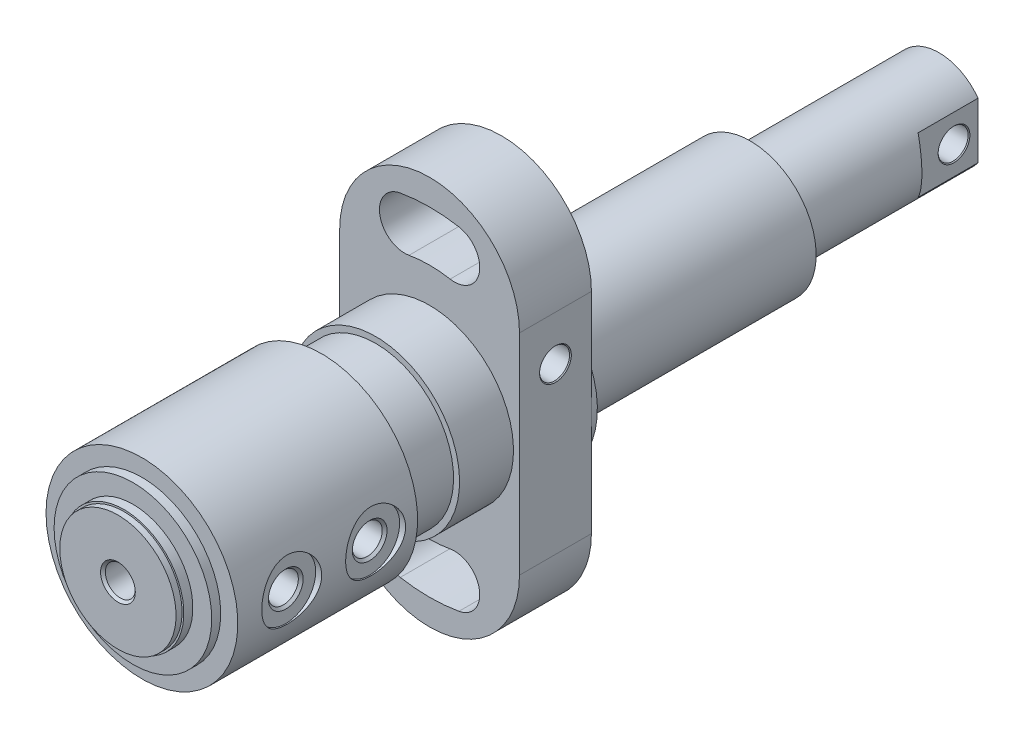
ISO-10303-21;
HEADER;
FILE_DESCRIPTION(('STEP AP214'),'2;1');
FILE_NAME('part.step','',(''),(''),'','','');
FILE_SCHEMA(('AUTOMOTIVE_DESIGN { 1 0 10303 214 1 1 1 1 }'));
ENDSEC;
DATA;
#1=APPLICATION_CONTEXT('core data for automotive mechanical design processes');
#2=APPLICATION_PROTOCOL_DEFINITION('international standard','automotive_design',2000,#1);
#3=PRODUCT_CONTEXT('',#1,'mechanical');
#4=PRODUCT('Part','Part','',(#3));
#5=PRODUCT_RELATED_PRODUCT_CATEGORY('part','',(#4));
#6=PRODUCT_DEFINITION_FORMATION('','',#4);
#7=PRODUCT_DEFINITION_CONTEXT('part definition',#1,'design');
#8=PRODUCT_DEFINITION('design','',#6,#7);
#9=PRODUCT_DEFINITION_SHAPE('','',#8);
#10=(LENGTH_UNIT() NAMED_UNIT(*) SI_UNIT(.MILLI.,.METRE.));
#11=(NAMED_UNIT(*) PLANE_ANGLE_UNIT() SI_UNIT($,.RADIAN.));
#12=(NAMED_UNIT(*) SI_UNIT($,.STERADIAN.) SOLID_ANGLE_UNIT());
#13=UNCERTAINTY_MEASURE_WITH_UNIT(LENGTH_MEASURE(1.E-05),#10,'distance_accuracy_value','');
#14=(GEOMETRIC_REPRESENTATION_CONTEXT(3) GLOBAL_UNCERTAINTY_ASSIGNED_CONTEXT((#13)) GLOBAL_UNIT_ASSIGNED_CONTEXT((#10,
#11,#12)) REPRESENTATION_CONTEXT('',''));
#15=CARTESIAN_POINT('',(0.,0.,0.));
#16=DIRECTION('',(0.,0.,1.));
#17=DIRECTION('',(1.,0.,0.));
#18=AXIS2_PLACEMENT_3D('',#15,#16,#17);
#19=CARTESIAN_POINT('',(10.,0.,48.));
#20=DIRECTION('',(0.,0.,-1.));
#21=DIRECTION('',(0.,1.,0.));
#22=AXIS2_PLACEMENT_3D('',#19,#20,#21);
#23=PLANE('',#22);
#24=CARTESIAN_POINT('',(0.,0.,48.));
#25=DIRECTION('',(0.,0.,-1.));
#26=DIRECTION('',(-1.,0.,0.));
#27=AXIS2_PLACEMENT_3D('',#24,#25,#26);
#28=CIRCLE('',#27,13.15);
#29=CARTESIAN_POINT('',(-13.15,0.,48.));
#30=VERTEX_POINT('',#29);
#31=EDGE_CURVE('E9',#30,#30,#28,.F.);
#32=ORIENTED_EDGE('',*,*,#31,.F.);
#33=EDGE_LOOP('',(#32));
#34=FACE_BOUND('',#33,.T.);
#35=CARTESIAN_POINT('',(0.,0.,48.));
#36=DIRECTION('',(0.,0.,-1.));
#37=DIRECTION('',(-1.,0.,0.));
#38=AXIS2_PLACEMENT_3D('',#35,#36,#37);
#39=CIRCLE('',#38,16.);
#40=CARTESIAN_POINT('',(-16.,0.,48.));
#41=VERTEX_POINT('',#40);
#42=EDGE_CURVE('E317',#41,#41,#39,.T.);
#43=ORIENTED_EDGE('',*,*,#42,.F.);
#44=EDGE_LOOP('',(#43));
#45=FACE_BOUND('',#44,.T.);
#46=ADVANCED_FACE('F14',(#34,#45),#23,.F.);
#47=CARTESIAN_POINT('',(0.,0.,1.));
#48=DIRECTION('',(0.,0.,-1.));
#49=DIRECTION('',(-0.999988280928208,-0.00484128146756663,0.));
#50=AXIS2_PLACEMENT_3D('',#47,#48,#49);
#51=CYLINDRICAL_SURFACE('',#50,10.);
#52=CARTESIAN_POINT('',(0.,0.,49.5));
#53=DIRECTION('',(0.,0.,-1.));
#54=DIRECTION('',(-0.999988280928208,-0.00484128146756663,0.));
#55=AXIS2_PLACEMENT_3D('',#52,#53,#54);
#56=CIRCLE('',#55,10.);
#57=CARTESIAN_POINT('',(-9.99988280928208,-0.0484128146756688,49.5));
#58=VERTEX_POINT('',#57);
#59=EDGE_CURVE('E330',#58,#58,#56,.T.);
#60=ORIENTED_EDGE('',*,*,#59,.F.);
#61=EDGE_LOOP('',(#60));
#62=FACE_BOUND('',#61,.T.);
#63=CARTESIAN_POINT('',(0.,0.,51.));
#64=DIRECTION('',(0.,0.,-1.));
#65=DIRECTION('',(-1.,0.,0.));
#66=AXIS2_PLACEMENT_3D('',#63,#64,#65);
#67=CIRCLE('',#66,10.);
#68=CARTESIAN_POINT('',(-10.,0.,51.));
#69=VERTEX_POINT('',#68);
#70=EDGE_CURVE('E320',#69,#69,#67,.T.);
#71=ORIENTED_EDGE('',*,*,#70,.T.);
#72=EDGE_LOOP('',(#71));
#73=FACE_BOUND('',#72,.T.);
#74=ADVANCED_FACE('F403',(#62,#73),#51,.T.);
#75=CARTESIAN_POINT('',(0.,0.,49.5));
#76=DIRECTION('',(0.,0.,1.));
#77=DIRECTION('',(1.,0.,0.));
#78=AXIS2_PLACEMENT_3D('',#75,#76,#77);
#79=PLANE('',#78);
#80=CARTESIAN_POINT('',(0.,0.,49.5));
#81=DIRECTION('',(0.,0.,1.));
#82=DIRECTION('',(1.,0.,0.));
#83=AXIS2_PLACEMENT_3D('',#80,#81,#82);
#84=CIRCLE('',#83,13.15);
#85=CARTESIAN_POINT('',(13.15,0.,49.5));
#86=VERTEX_POINT('',#85);
#87=EDGE_CURVE('E326',#86,#86,#84,.T.);
#88=ORIENTED_EDGE('',*,*,#87,.T.);
#89=EDGE_LOOP('',(#88));
#90=FACE_BOUND('',#89,.T.);
#91=ORIENTED_EDGE('',*,*,#59,.T.);
#92=EDGE_LOOP('',(#91));
#93=FACE_BOUND('',#92,.T.);
#94=ADVANCED_FACE('F406',(#90,#93),#79,.T.);
#95=CARTESIAN_POINT('',(0.,0.,49.5));
#96=DIRECTION('',(0.,0.,-1.));
#97=DIRECTION('',(-1.,0.,0.));
#98=AXIS2_PLACEMENT_3D('',#95,#96,#97);
#99=CYLINDRICAL_SURFACE('',#98,13.15);
#100=ORIENTED_EDGE('',*,*,#87,.F.);
#101=EDGE_LOOP('',(#100));
#102=FACE_BOUND('',#101,.T.);
#103=ORIENTED_EDGE('',*,*,#31,.T.);
#104=EDGE_LOOP('',(#103));
#105=FACE_BOUND('',#104,.T.);
#106=ADVANCED_FACE('F420',(#102,#105),#99,.T.);
#107=CARTESIAN_POINT('',(-9.7,0.,51.));
#108=DIRECTION('',(0.,0.,1.));
#109=DIRECTION('',(1.,0.,0.));
#110=AXIS2_PLACEMENT_3D('',#107,#108,#109);
#111=PLANE('',#110);
#112=CARTESIAN_POINT('',(0.,0.,51.));
#113=DIRECTION('',(0.,0.,-1.));
#114=DIRECTION('',(-0.999988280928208,-0.00484128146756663,0.));
#115=AXIS2_PLACEMENT_3D('',#112,#113,#114);
#116=CIRCLE('',#115,9.7);
#117=CARTESIAN_POINT('',(-9.69988632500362,-0.0469604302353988,51.));
#118=VERTEX_POINT('',#117);
#119=EDGE_CURVE('E333',#118,#118,#116,.T.);
#120=ORIENTED_EDGE('',*,*,#119,.T.);
#121=EDGE_LOOP('',(#120));
#122=FACE_BOUND('',#121,.T.);
#123=ORIENTED_EDGE('',*,*,#70,.F.);
#124=EDGE_LOOP('',(#123));
#125=FACE_BOUND('',#124,.T.);
#126=ADVANCED_FACE('F415',(#122,#125),#111,.T.);
#127=CARTESIAN_POINT('',(0.,0.,52.));
#128=DIRECTION('',(0.,0.,1.));
#129=DIRECTION('',(0.999988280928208,0.00484128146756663,0.));
#130=AXIS2_PLACEMENT_3D('',#127,#128,#129);
#131=CONICAL_SURFACE('',#130,2.9,0.785398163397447);
#132=CARTESIAN_POINT('',(0.,0.,51.6));
#133=DIRECTION('',(0.,0.,1.));
#134=DIRECTION('',(1.,0.,0.));
#135=AXIS2_PLACEMENT_3D('',#132,#133,#134);
#136=CIRCLE('',#135,2.5);
#137=CARTESIAN_POINT('',(2.5,0.,51.6));
#138=VERTEX_POINT('',#137);
#139=EDGE_CURVE('E290',#138,#138,#136,.F.);
#140=ORIENTED_EDGE('',*,*,#139,.T.);
#141=EDGE_LOOP('',(#140));
#142=FACE_BOUND('',#141,.T.);
#143=CARTESIAN_POINT('',(0.,0.,52.));
#144=DIRECTION('',(0.,0.,1.));
#145=DIRECTION('',(0.999988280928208,0.00484128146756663,0.));
#146=AXIS2_PLACEMENT_3D('',#143,#144,#145);
#147=CIRCLE('',#146,2.9);
#148=CARTESIAN_POINT('',(2.8999660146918,0.0140397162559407,52.));
#149=VERTEX_POINT('',#148);
#150=EDGE_CURVE('E23',#149,#149,#147,.T.);
#151=ORIENTED_EDGE('',*,*,#150,.T.);
#152=EDGE_LOOP('',(#151));
#153=FACE_BOUND('',#152,.T.);
#154=ADVANCED_FACE('F411',(#142,#153),#131,.F.);
#155=CARTESIAN_POINT('',(9.99988280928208,0.0484128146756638,52.));
#156=DIRECTION('',(0.,0.,-1.));
#157=DIRECTION('',(-0.999988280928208,-0.00484128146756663,0.));
#158=AXIS2_PLACEMENT_3D('',#155,#156,#157);
#159=PLANE('',#158);
#160=ORIENTED_EDGE('',*,*,#150,.F.);
#161=EDGE_LOOP('',(#160));
#162=FACE_BOUND('',#161,.T.);
#163=CARTESIAN_POINT('',(0.,0.,52.));
#164=DIRECTION('',(0.,0.,-1.));
#165=DIRECTION('',(-1.,0.,0.));
#166=AXIS2_PLACEMENT_3D('',#163,#164,#165);
#167=CIRCLE('',#166,9.7);
#168=CARTESIAN_POINT('',(-9.7,0.,52.));
#169=VERTEX_POINT('',#168);
#170=EDGE_CURVE('E323',#169,#169,#167,.T.);
#171=ORIENTED_EDGE('',*,*,#170,.F.);
#172=EDGE_LOOP('',(#171));
#173=FACE_BOUND('',#172,.T.);
#174=ADVANCED_FACE('F408',(#162,#173),#159,.F.);
#175=CARTESIAN_POINT('',(0.,0.,1.));
#176=DIRECTION('',(0.,0.,-1.));
#177=DIRECTION('',(-0.999988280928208,-0.00484128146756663,0.));
#178=AXIS2_PLACEMENT_3D('',#175,#176,#177);
#179=CYLINDRICAL_SURFACE('',#178,9.7);
#180=ORIENTED_EDGE('',*,*,#119,.F.);
#181=EDGE_LOOP('',(#180));
#182=FACE_BOUND('',#181,.T.);
#183=ORIENTED_EDGE('',*,*,#170,.T.);
#184=EDGE_LOOP('',(#183));
#185=FACE_BOUND('',#184,.T.);
#186=ADVANCED_FACE('F389',(#182,#185),#179,.T.);
#187=CARTESIAN_POINT('',(15.,0.,39.));
#188=DIRECTION('',(1.,0.,0.));
#189=DIRECTION('',(0.,-1.,0.));
#190=AXIS2_PLACEMENT_3D('',#187,#188,#189);
#191=CONICAL_SURFACE('',#190,2.9,0.785398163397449);
#192=CARTESIAN_POINT('',(14.6,0.,39.));
#193=DIRECTION('',(1.,0.,0.));
#194=DIRECTION('',(0.,1.,0.));
#195=AXIS2_PLACEMENT_3D('',#192,#193,#194);
#196=CIRCLE('',#195,2.5);
#197=CARTESIAN_POINT('',(14.6,2.5,39.));
#198=VERTEX_POINT('',#197);
#199=EDGE_CURVE('E293',#198,#198,#196,.F.);
#200=ORIENTED_EDGE('',*,*,#199,.T.);
#201=EDGE_LOOP('',(#200));
#202=FACE_BOUND('',#201,.T.);
#203=CARTESIAN_POINT('',(15.,0.,39.));
#204=DIRECTION('',(1.,0.,0.));
#205=DIRECTION('',(0.,-1.,0.));
#206=AXIS2_PLACEMENT_3D('',#203,#204,#205);
#207=CIRCLE('',#206,2.9);
#208=CARTESIAN_POINT('',(15.,-2.9,39.));
#209=VERTEX_POINT('',#208);
#210=EDGE_CURVE('E344',#209,#209,#207,.T.);
#211=ORIENTED_EDGE('',*,*,#210,.T.);
#212=EDGE_LOOP('',(#211));
#213=FACE_BOUND('',#212,.T.);
#214=ADVANCED_FACE('F386',(#202,#213),#191,.F.);
#215=CARTESIAN_POINT('',(15.,0.,25.));
#216=DIRECTION('',(1.,0.,0.));
#217=DIRECTION('',(0.,-1.,0.));
#218=AXIS2_PLACEMENT_3D('',#215,#216,#217);
#219=CONICAL_SURFACE('',#218,2.9,0.785398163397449);
#220=CARTESIAN_POINT('',(14.6,0.,25.));
#221=DIRECTION('',(1.,0.,0.));
#222=DIRECTION('',(0.,1.,0.));
#223=AXIS2_PLACEMENT_3D('',#220,#221,#222);
#224=CIRCLE('',#223,2.5);
#225=CARTESIAN_POINT('',(14.6,2.5,25.));
#226=VERTEX_POINT('',#225);
#227=EDGE_CURVE('E18',#226,#226,#224,.F.);
#228=ORIENTED_EDGE('',*,*,#227,.T.);
#229=EDGE_LOOP('',(#228));
#230=FACE_BOUND('',#229,.T.);
#231=CARTESIAN_POINT('',(15.,0.,25.));
#232=DIRECTION('',(1.,0.,0.));
#233=DIRECTION('',(0.,-1.,0.));
#234=AXIS2_PLACEMENT_3D('',#231,#232,#233);
#235=CIRCLE('',#234,2.9);
#236=CARTESIAN_POINT('',(15.,-2.9,25.));
#237=VERTEX_POINT('',#236);
#238=EDGE_CURVE('E341',#237,#237,#235,.T.);
#239=ORIENTED_EDGE('',*,*,#238,.T.);
#240=EDGE_LOOP('',(#239));
#241=FACE_BOUND('',#240,.T.);
#242=ADVANCED_FACE('F384',(#230,#241),#219,.F.);
#243=CARTESIAN_POINT('',(15.,0.,39.));
#244=DIRECTION('',(1.,0.,0.));
#245=DIRECTION('',(0.,-1.,0.));
#246=AXIS2_PLACEMENT_3D('',#243,#244,#245);
#247=PLANE('',#246);
#248=ORIENTED_EDGE('',*,*,#210,.F.);
#249=EDGE_LOOP('',(#248));
#250=FACE_BOUND('',#249,.T.);
#251=CARTESIAN_POINT('',(15.,0.,39.));
#252=DIRECTION('',(1.,0.,0.));
#253=DIRECTION('',(0.,-1.,0.));
#254=AXIS2_PLACEMENT_3D('',#251,#252,#253);
#255=CIRCLE('',#254,5.);
#256=CARTESIAN_POINT('',(15.,-5.,39.));
#257=VERTEX_POINT('',#256);
#258=EDGE_CURVE('E347',#257,#257,#255,.T.);
#259=ORIENTED_EDGE('',*,*,#258,.T.);
#260=EDGE_LOOP('',(#259));
#261=FACE_BOUND('',#260,.T.);
#262=ADVANCED_FACE('F376',(#250,#261),#247,.T.);
#263=CARTESIAN_POINT('',(15.,0.,25.));
#264=DIRECTION('',(1.,0.,0.));
#265=DIRECTION('',(0.,-1.,0.));
#266=AXIS2_PLACEMENT_3D('',#263,#264,#265);
#267=PLANE('',#266);
#268=ORIENTED_EDGE('',*,*,#238,.F.);
#269=EDGE_LOOP('',(#268));
#270=FACE_BOUND('',#269,.T.);
#271=CARTESIAN_POINT('',(15.,0.,25.));
#272=DIRECTION('',(1.,0.,0.));
#273=DIRECTION('',(0.,-1.,0.));
#274=AXIS2_PLACEMENT_3D('',#271,#272,#273);
#275=CIRCLE('',#274,5.);
#276=CARTESIAN_POINT('',(15.,-5.,25.));
#277=VERTEX_POINT('',#276);
#278=EDGE_CURVE('E350',#277,#277,#275,.T.);
#279=ORIENTED_EDGE('',*,*,#278,.T.);
#280=EDGE_LOOP('',(#279));
#281=FACE_BOUND('',#280,.T.);
#282=ADVANCED_FACE('F374',(#270,#281),#267,.T.);
#283=CARTESIAN_POINT('',(15.,0.,39.));
#284=DIRECTION('',(1.,0.,0.));
#285=DIRECTION('',(0.,-1.,0.));
#286=AXIS2_PLACEMENT_3D('',#283,#284,#285);
#287=CYLINDRICAL_SURFACE('',#286,5.);
#288=ORIENTED_EDGE('',*,*,#258,.F.);
#289=EDGE_LOOP('',(#288));
#290=FACE_BOUND('',#289,.T.);
#291=CARTESIAN_POINT('',(15.1986841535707,-5.,39.));
#292=CARTESIAN_POINT('',(15.1986858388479,-4.99999815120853,39.2733881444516));
#293=CARTESIAN_POINT('',(15.206141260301,-4.97750155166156,39.5467950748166));
#294=CARTESIAN_POINT('',(15.2350255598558,-4.88836701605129,40.0855766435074));
#295=CARTESIAN_POINT('',(15.2564582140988,-4.82171715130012,40.3509490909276));
#296=CARTESIAN_POINT('',(15.3106375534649,-4.64679152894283,40.865779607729));
#297=CARTESIAN_POINT('',(15.3433642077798,-4.53858942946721,41.115264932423));
#298=CARTESIAN_POINT('',(15.4164162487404,-4.28387656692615,41.5926107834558));
#299=CARTESIAN_POINT('',(15.4567429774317,-4.13735903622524,41.8204674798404));
#300=CARTESIAN_POINT('',(15.5420051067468,-3.80478428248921,42.255915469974));
#301=CARTESIAN_POINT('',(15.5870449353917,-3.61763759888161,42.462654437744));
#302=CARTESIAN_POINT('',(15.6757698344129,-3.21144818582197,42.8423840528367));
#303=CARTESIAN_POINT('',(15.719454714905,-2.99240101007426,43.0153699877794));
#304=CARTESIAN_POINT('',(15.8017421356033,-2.52250364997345,43.326444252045));
#305=CARTESIAN_POINT('',(15.8402073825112,-2.27104622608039,43.4636548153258));
#306=CARTESIAN_POINT('',(15.9065020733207,-1.74721693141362,43.6935041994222));
#307=CARTESIAN_POINT('',(15.9343340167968,-1.47484999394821,43.7861534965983));
#308=CARTESIAN_POINT('',(15.9754870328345,-0.925857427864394,43.9214045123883));
#309=CARTESIAN_POINT('',(15.9892295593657,-0.649622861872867,43.9654629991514));
#310=CARTESIAN_POINT('',(16.0021438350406,-0.0933632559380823,44.0068973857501));
#311=CARTESIAN_POINT('',(16.0013188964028,0.186660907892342,44.0042838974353));
#312=CARTESIAN_POINT('',(15.9854846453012,0.732297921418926,43.9534068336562));
#313=CARTESIAN_POINT('',(15.9709660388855,0.998074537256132,43.906722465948));
#314=CARTESIAN_POINT('',(15.929979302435,1.51781225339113,43.7716200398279));
#315=CARTESIAN_POINT('',(15.9035103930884,1.77177258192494,43.6831992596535));
#316=CARTESIAN_POINT('',(15.8409383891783,2.26431241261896,43.4661192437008));
#317=CARTESIAN_POINT('',(15.8047213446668,2.5026656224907,43.336980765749));
#318=CARTESIAN_POINT('',(15.7264689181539,2.95481004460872,43.0425156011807));
#319=CARTESIAN_POINT('',(15.6844320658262,3.16859502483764,42.8771797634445));
#320=CARTESIAN_POINT('',(15.5969468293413,3.57495079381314,42.5069054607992));
#321=CARTESIAN_POINT('',(15.5514292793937,3.76626619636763,42.3006037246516));
#322=CARTESIAN_POINT('',(15.4636246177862,4.11195897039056,41.8584195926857));
#323=CARTESIAN_POINT('',(15.4213378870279,4.26633199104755,41.6225337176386));
#324=CARTESIAN_POINT('',(15.3444338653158,4.53521860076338,41.1243301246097));
#325=CARTESIAN_POINT('',(15.3099076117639,4.64926722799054,40.8617463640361));
#326=CARTESIAN_POINT('',(15.253501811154,4.83113383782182,40.319762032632));
#327=CARTESIAN_POINT('',(15.2316177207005,4.89896843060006,40.0403675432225));
#328=CARTESIAN_POINT('',(15.2039825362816,4.9840594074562,39.4847201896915));
#329=CARTESIAN_POINT('',(15.1976186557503,5.00323817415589,39.2087920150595));
#330=CARTESIAN_POINT('',(15.200043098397,4.99586977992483,38.6576410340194));
#331=CARTESIAN_POINT('',(15.2088290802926,4.96932968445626,38.3824181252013));
#332=CARTESIAN_POINT('',(15.2399582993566,4.87299494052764,37.8487668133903));
#333=CARTESIAN_POINT('',(15.2619021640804,4.80447324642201,37.5900829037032));
#334=CARTESIAN_POINT('',(15.3164514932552,4.62761494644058,37.0879128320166));
#335=CARTESIAN_POINT('',(15.3490586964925,4.51927184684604,36.8444291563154));
#336=CARTESIAN_POINT('',(15.4224215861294,4.26230042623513,36.3718435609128));
#337=CARTESIAN_POINT('',(15.4633841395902,4.11260589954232,36.1433543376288));
#338=CARTESIAN_POINT('',(15.5484139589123,3.7784256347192,35.7140386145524));
#339=CARTESIAN_POINT('',(15.5924820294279,3.59393085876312,35.5132193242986));
#340=CARTESIAN_POINT('',(15.6809675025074,3.18629179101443,35.1363585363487));
#341=CARTESIAN_POINT('',(15.7253236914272,2.96186259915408,34.9616888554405));
#342=CARTESIAN_POINT('',(15.8075623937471,2.48580618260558,34.652435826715));
#343=CARTESIAN_POINT('',(15.8454452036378,2.23418020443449,34.5178506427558));
#344=CARTESIAN_POINT('',(15.9102524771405,1.71242209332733,34.2938777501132));
#345=CARTESIAN_POINT('',(15.937255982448,1.44244073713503,34.2041628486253));
#346=CARTESIAN_POINT('',(15.9776097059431,0.890229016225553,34.0717098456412));
#347=CARTESIAN_POINT('',(15.9909641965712,0.608002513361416,34.028957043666));
#348=CARTESIAN_POINT('',(16.0022321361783,0.0519397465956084,33.9928359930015));
#349=CARTESIAN_POINT('',(16.0007651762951,-0.221756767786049,33.9974861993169));
#350=CARTESIAN_POINT('',(15.9840391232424,-0.764292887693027,34.0512472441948));
#351=CARTESIAN_POINT('',(15.9687809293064,-1.03313280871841,34.100355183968));
#352=CARTESIAN_POINT('',(15.9263828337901,-1.55502047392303,34.2403760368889));
#353=CARTESIAN_POINT('',(15.899393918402,-1.80822367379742,34.3307584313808));
#354=CARTESIAN_POINT('',(15.8363178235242,-2.29599370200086,34.5502833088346));
#355=CARTESIAN_POINT('',(15.8002290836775,-2.53055732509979,34.6794324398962));
#356=CARTESIAN_POINT('',(15.7211958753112,-2.98304677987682,34.9778910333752));
#357=CARTESIAN_POINT('',(15.6780603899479,-3.20013842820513,35.148414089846));
#358=CARTESIAN_POINT('',(15.590349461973,-3.60328316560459,35.5226395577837));
#359=CARTESIAN_POINT('',(15.5457735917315,-3.78932693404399,35.7263518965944));
#360=CARTESIAN_POINT('',(15.4584757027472,-4.13131463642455,36.1692628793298));
#361=CARTESIAN_POINT('',(15.4158640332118,-4.28605711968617,36.4094136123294));
#362=CARTESIAN_POINT('',(15.3392050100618,-4.5528188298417,36.9135924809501));
#363=CARTESIAN_POINT('',(15.3051541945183,-4.66485533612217,37.1776109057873));
#364=CARTESIAN_POINT('',(15.2522624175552,-4.83484721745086,37.6988904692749));
#365=CARTESIAN_POINT('',(15.2323726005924,-4.89659759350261,37.9548101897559));
#366=CARTESIAN_POINT('',(15.2055842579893,-4.97916983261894,38.4738153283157));
#367=CARTESIAN_POINT('',(15.1986825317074,-5.00000177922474,38.7368989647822));
#368=CARTESIAN_POINT('',(15.1986841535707,-5.,39.));
#369=B_SPLINE_CURVE_WITH_KNOTS('',3,(#291,#292,#293,#294,#295,#296,#297,#298,#299,#300,#301,
#302,#303,#304,#305,#306,#307,#308,#309,#310,#311,#312,#313,#314,#315,#316,#317,#318,#319,#320,
#321,#322,#323,#324,#325,#326,#327,#328,#329,#330,#331,#332,#333,#334,#335,#336,#337,#338,#339,
#340,#341,#342,#343,#344,#345,#346,#347,#348,#349,#350,#351,#352,#353,#354,#355,#356,#357,#358,
#359,#360,#361,#362,#363,#364,#365,#366,#367,#368),.UNSPECIFIED.,.T.,.F.,(4,2,2,2,2,2,2,2,2,2,2,
2,2,2,2,2,2,2,2,2,2,2,2,2,2,2,2,2,2,2,2,2,2,2,2,2,2,2,4),(0.,0.819192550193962,1.63860650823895,
2.45657457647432,3.27468721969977,4.11828322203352,4.96199691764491,5.82479287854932,
6.68738589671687,7.52334891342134,8.35912185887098,9.16603931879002,9.97300940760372,
10.7898561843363,11.6069097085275,12.4580135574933,13.309217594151,14.1699388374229,
15.0303505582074,15.8561973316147,16.6819164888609,17.4837588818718,18.2857320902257,
19.1107045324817,19.9358915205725,20.7952775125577,21.6546241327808,22.5076095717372,
23.3603279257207,24.1775520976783,24.9947229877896,25.8016738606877,26.6087631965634,
27.4432277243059,28.2779423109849,29.1403118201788,30.002332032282,30.7908941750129,
31.5792619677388),.UNSPECIFIED.);
#370=CARTESIAN_POINT('',(15.1986841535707,-5.,39.));
#371=VERTEX_POINT('',#370);
#372=EDGE_CURVE('E334',#371,#371,#369,.T.);
#373=ORIENTED_EDGE('',*,*,#372,.F.);
#374=EDGE_LOOP('',(#373));
#375=FACE_BOUND('',#374,.T.);
#376=ADVANCED_FACE('F372',(#290,#375),#287,.F.);
#377=CARTESIAN_POINT('',(15.,0.,25.));
#378=DIRECTION('',(1.,0.,0.));
#379=DIRECTION('',(0.,-1.,0.));
#380=AXIS2_PLACEMENT_3D('',#377,#378,#379);
#381=CYLINDRICAL_SURFACE('',#380,5.);
#382=ORIENTED_EDGE('',*,*,#278,.F.);
#383=EDGE_LOOP('',(#382));
#384=FACE_BOUND('',#383,.T.);
#385=CARTESIAN_POINT('',(15.1986841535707,-5.,25.));
#386=CARTESIAN_POINT('',(15.1986858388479,-4.99999815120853,25.2733881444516));
#387=CARTESIAN_POINT('',(15.206141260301,-4.97750155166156,25.5467950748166));
#388=CARTESIAN_POINT('',(15.2350255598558,-4.88836701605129,26.0855766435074));
#389=CARTESIAN_POINT('',(15.2564582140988,-4.82171715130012,26.3509490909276));
#390=CARTESIAN_POINT('',(15.3106375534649,-4.64679152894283,26.865779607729));
#391=CARTESIAN_POINT('',(15.3433642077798,-4.53858942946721,27.115264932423));
#392=CARTESIAN_POINT('',(15.4164162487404,-4.28387656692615,27.5926107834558));
#393=CARTESIAN_POINT('',(15.4567429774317,-4.13735903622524,27.8204674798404));
#394=CARTESIAN_POINT('',(15.5420051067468,-3.80478428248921,28.255915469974));
#395=CARTESIAN_POINT('',(15.5870449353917,-3.61763759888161,28.462654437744));
#396=CARTESIAN_POINT('',(15.6757698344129,-3.21144818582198,28.8423840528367));
#397=CARTESIAN_POINT('',(15.719454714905,-2.99240101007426,29.0153699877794));
#398=CARTESIAN_POINT('',(15.8017421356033,-2.52250364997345,29.326444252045));
#399=CARTESIAN_POINT('',(15.8402073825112,-2.27104622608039,29.4636548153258));
#400=CARTESIAN_POINT('',(15.9065020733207,-1.74721693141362,29.6935041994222));
#401=CARTESIAN_POINT('',(15.9343340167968,-1.47484999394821,29.7861534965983));
#402=CARTESIAN_POINT('',(15.9754870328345,-0.92585742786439,29.9214045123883));
#403=CARTESIAN_POINT('',(15.9892295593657,-0.649622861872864,29.9654629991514));
#404=CARTESIAN_POINT('',(16.0021438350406,-0.0933632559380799,30.0068973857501));
#405=CARTESIAN_POINT('',(16.0013188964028,0.186660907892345,30.0042838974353));
#406=CARTESIAN_POINT('',(15.9854846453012,0.732297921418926,29.9534068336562));
#407=CARTESIAN_POINT('',(15.9709660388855,0.998074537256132,29.906722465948));
#408=CARTESIAN_POINT('',(15.929979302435,1.51781225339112,29.7716200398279));
#409=CARTESIAN_POINT('',(15.9035103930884,1.77177258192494,29.6831992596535));
#410=CARTESIAN_POINT('',(15.8409383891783,2.26431241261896,29.4661192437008));
#411=CARTESIAN_POINT('',(15.8047213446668,2.5026656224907,29.336980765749));
#412=CARTESIAN_POINT('',(15.7264689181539,2.95481004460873,29.0425156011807));
#413=CARTESIAN_POINT('',(15.6844320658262,3.16859502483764,28.8771797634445));
#414=CARTESIAN_POINT('',(15.5969468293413,3.57495079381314,28.5069054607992));
#415=CARTESIAN_POINT('',(15.5514292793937,3.76626619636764,28.3006037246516));
#416=CARTESIAN_POINT('',(15.4636246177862,4.11195897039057,27.8584195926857));
#417=CARTESIAN_POINT('',(15.4213378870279,4.26633199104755,27.6225337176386));
#418=CARTESIAN_POINT('',(15.3444338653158,4.53521860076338,27.1243301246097));
#419=CARTESIAN_POINT('',(15.3099076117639,4.64926722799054,26.8617463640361));
#420=CARTESIAN_POINT('',(15.253501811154,4.83113383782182,26.319762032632));
#421=CARTESIAN_POINT('',(15.2316177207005,4.89896843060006,26.0403675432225));
#422=CARTESIAN_POINT('',(15.2039825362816,4.9840594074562,25.4847201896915));
#423=CARTESIAN_POINT('',(15.1976186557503,5.00323817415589,25.2087920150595));
#424=CARTESIAN_POINT('',(15.200043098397,4.99586977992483,24.6576410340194));
#425=CARTESIAN_POINT('',(15.2088290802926,4.96932968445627,24.3824181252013));
#426=CARTESIAN_POINT('',(15.2399582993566,4.87299494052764,23.8487668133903));
#427=CARTESIAN_POINT('',(15.2619021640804,4.80447324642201,23.5900829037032));
#428=CARTESIAN_POINT('',(15.3164514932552,4.62761494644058,23.0879128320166));
#429=CARTESIAN_POINT('',(15.3490586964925,4.51927184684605,22.8444291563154));
#430=CARTESIAN_POINT('',(15.4224215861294,4.26230042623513,22.3718435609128));
#431=CARTESIAN_POINT('',(15.4633841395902,4.11260589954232,22.1433543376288));
#432=CARTESIAN_POINT('',(15.5484139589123,3.7784256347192,21.7140386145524));
#433=CARTESIAN_POINT('',(15.5924820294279,3.59393085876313,21.5132193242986));
#434=CARTESIAN_POINT('',(15.6809675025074,3.18629179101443,21.1363585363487));
#435=CARTESIAN_POINT('',(15.7253236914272,2.96186259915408,20.9616888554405));
#436=CARTESIAN_POINT('',(15.8075623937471,2.48580618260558,20.652435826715));
#437=CARTESIAN_POINT('',(15.8454452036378,2.23418020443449,20.5178506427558));
#438=CARTESIAN_POINT('',(15.9102524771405,1.71242209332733,20.2938777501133));
#439=CARTESIAN_POINT('',(15.937255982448,1.44244073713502,20.2041628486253));
#440=CARTESIAN_POINT('',(15.9776097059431,0.89022901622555,20.0717098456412));
#441=CARTESIAN_POINT('',(15.9909641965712,0.608002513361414,20.028957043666));
#442=CARTESIAN_POINT('',(16.0022321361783,0.0519397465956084,19.9928359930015));
#443=CARTESIAN_POINT('',(16.0007651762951,-0.221756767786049,19.9974861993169));
#444=CARTESIAN_POINT('',(15.9840391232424,-0.764292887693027,20.0512472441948));
#445=CARTESIAN_POINT('',(15.9687809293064,-1.03313280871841,20.100355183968));
#446=CARTESIAN_POINT('',(15.9263828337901,-1.55502047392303,20.2403760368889));
#447=CARTESIAN_POINT('',(15.899393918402,-1.80822367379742,20.3307584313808));
#448=CARTESIAN_POINT('',(15.8363178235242,-2.29599370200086,20.5502833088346));
#449=CARTESIAN_POINT('',(15.8002290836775,-2.53055732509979,20.6794324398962));
#450=CARTESIAN_POINT('',(15.7211958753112,-2.98304677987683,20.9778910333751));
#451=CARTESIAN_POINT('',(15.6780603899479,-3.20013842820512,21.148414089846));
#452=CARTESIAN_POINT('',(15.590349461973,-3.60328316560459,21.5226395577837));
#453=CARTESIAN_POINT('',(15.5457735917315,-3.78932693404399,21.7263518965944));
#454=CARTESIAN_POINT('',(15.4584757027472,-4.13131463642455,22.1692628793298));
#455=CARTESIAN_POINT('',(15.4158640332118,-4.28605711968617,22.4094136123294));
#456=CARTESIAN_POINT('',(15.3392050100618,-4.5528188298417,22.9135924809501));
#457=CARTESIAN_POINT('',(15.3051541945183,-4.66485533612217,23.1776109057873));
#458=CARTESIAN_POINT('',(15.2522624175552,-4.83484721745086,23.6988904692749));
#459=CARTESIAN_POINT('',(15.2323726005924,-4.89659759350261,23.9548101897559));
#460=CARTESIAN_POINT('',(15.2055842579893,-4.97916983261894,24.4738153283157));
#461=CARTESIAN_POINT('',(15.1986825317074,-5.00000177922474,24.7368989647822));
#462=CARTESIAN_POINT('',(15.1986841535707,-5.,25.));
#463=B_SPLINE_CURVE_WITH_KNOTS('',3,(#385,#386,#387,#388,#389,#390,#391,#392,#393,#394,#395,
#396,#397,#398,#399,#400,#401,#402,#403,#404,#405,#406,#407,#408,#409,#410,#411,#412,#413,#414,
#415,#416,#417,#418,#419,#420,#421,#422,#423,#424,#425,#426,#427,#428,#429,#430,#431,#432,#433,
#434,#435,#436,#437,#438,#439,#440,#441,#442,#443,#444,#445,#446,#447,#448,#449,#450,#451,#452,
#453,#454,#455,#456,#457,#458,#459,#460,#461,#462),.UNSPECIFIED.,.T.,.F.,(4,2,2,2,2,2,2,2,2,2,2,
2,2,2,2,2,2,2,2,2,2,2,2,2,2,2,2,2,2,2,2,2,2,2,2,2,2,2,4),(0.,0.819192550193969,1.63860650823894,
2.45657457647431,3.27468721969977,4.11828322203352,4.9619969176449,5.82479287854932,
6.68738589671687,7.52334891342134,8.35912185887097,9.16603931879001,9.97300940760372,
10.7898561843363,11.6069097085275,12.4580135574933,13.309217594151,14.1699388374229,
15.0303505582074,15.8561973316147,16.6819164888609,17.4837588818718,18.2857320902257,
19.1107045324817,19.9358915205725,20.7952775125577,21.6546241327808,22.5076095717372,
23.3603279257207,24.1775520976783,24.9947229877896,25.8016738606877,26.6087631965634,
27.4432277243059,28.2779423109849,29.1403118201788,30.002332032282,30.7908941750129,
31.5792619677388),.UNSPECIFIED.);
#464=CARTESIAN_POINT('',(15.1986841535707,-5.,25.));
#465=VERTEX_POINT('',#464);
#466=EDGE_CURVE('E353',#465,#465,#463,.T.);
#467=ORIENTED_EDGE('',*,*,#466,.F.);
#468=EDGE_LOOP('',(#467));
#469=FACE_BOUND('',#468,.T.);
#470=ADVANCED_FACE('F368',(#384,#469),#381,.F.);
#471=CARTESIAN_POINT('',(0.,0.,9.));
#472=DIRECTION('',(0.,0.,-1.));
#473=DIRECTION('',(0.,1.,0.));
#474=AXIS2_PLACEMENT_3D('',#471,#472,#473);
#475=CYLINDRICAL_SURFACE('',#474,16.);
#476=ORIENTED_EDGE('',*,*,#466,.T.);
#477=EDGE_LOOP('',(#476));
#478=FACE_BOUND('',#477,.T.);
#479=ORIENTED_EDGE('',*,*,#372,.T.);
#480=EDGE_LOOP('',(#479));
#481=FACE_BOUND('',#480,.T.);
#482=ORIENTED_EDGE('',*,*,#42,.T.);
#483=EDGE_LOOP('',(#482));
#484=FACE_BOUND('',#483,.T.);
#485=CARTESIAN_POINT('',(0.,0.,18.));
#486=DIRECTION('',(0.,0.,-1.));
#487=DIRECTION('',(-1.,0.,0.));
#488=AXIS2_PLACEMENT_3D('',#485,#486,#487);
#489=CIRCLE('',#488,16.);
#490=CARTESIAN_POINT('',(-16.,0.,18.));
#491=VERTEX_POINT('',#490);
#492=EDGE_CURVE('E314',#491,#491,#489,.T.);
#493=ORIENTED_EDGE('',*,*,#492,.F.);
#494=EDGE_LOOP('',(#493));
#495=FACE_BOUND('',#494,.T.);
#496=ADVANCED_FACE('F365',(#478,#481,#484,#495),#475,.T.);
#497=CARTESIAN_POINT('',(0.,0.,9.));
#498=DIRECTION('',(0.,0.,-1.));
#499=DIRECTION('',(0.,1.,0.));
#500=AXIS2_PLACEMENT_3D('',#497,#498,#499);
#501=CYLINDRICAL_SURFACE('',#500,13.);
#502=CARTESIAN_POINT('',(0.,0.,18.));
#503=DIRECTION('',(0.,0.,-1.));
#504=DIRECTION('',(0.,1.,0.));
#505=AXIS2_PLACEMENT_3D('',#502,#503,#504);
#506=CIRCLE('',#505,13.);
#507=CARTESIAN_POINT('',(0.,13.,18.));
#508=VERTEX_POINT('',#507);
#509=EDGE_CURVE('E329',#508,#508,#506,.T.);
#510=ORIENTED_EDGE('',*,*,#509,.T.);
#511=EDGE_LOOP('',(#510));
#512=FACE_BOUND('',#511,.T.);
#513=CARTESIAN_POINT('',(0.,0.,9.));
#514=DIRECTION('',(0.,0.,-1.));
#515=DIRECTION('',(-1.,0.,0.));
#516=AXIS2_PLACEMENT_3D('',#513,#514,#515);
#517=CIRCLE('',#516,13.);
#518=CARTESIAN_POINT('',(-13.,0.,9.));
#519=VERTEX_POINT('',#518);
#520=EDGE_CURVE('E273',#519,#519,#517,.T.);
#521=ORIENTED_EDGE('',*,*,#520,.F.);
#522=EDGE_LOOP('',(#521));
#523=FACE_BOUND('',#522,.T.);
#524=ADVANCED_FACE('F397',(#512,#523),#501,.T.);
#525=CARTESIAN_POINT('',(16.,0.,18.));
#526=DIRECTION('',(0.,0.,-1.));
#527=DIRECTION('',(0.,1.,0.));
#528=AXIS2_PLACEMENT_3D('',#525,#526,#527);
#529=PLANE('',#528);
#530=ORIENTED_EDGE('',*,*,#509,.F.);
#531=EDGE_LOOP('',(#530));
#532=FACE_BOUND('',#531,.T.);
#533=ORIENTED_EDGE('',*,*,#492,.T.);
#534=EDGE_LOOP('',(#533));
#535=FACE_BOUND('',#534,.T.);
#536=ADVANCED_FACE('F393',(#532,#535),#529,.T.);
#537=CARTESIAN_POINT('',(6.5,0.,-81.));
#538=DIRECTION('',(1.,0.,0.));
#539=DIRECTION('',(0.,-1.,0.));
#540=AXIS2_PLACEMENT_3D('',#537,#538,#539);
#541=CONICAL_SURFACE('',#540,2.65,0.785398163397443);
#542=CARTESIAN_POINT('',(6.35,0.,-81.));
#543=DIRECTION('',(1.,0.,0.));
#544=DIRECTION('',(0.,0.,-1.));
#545=AXIS2_PLACEMENT_3D('',#542,#543,#544);
#546=CIRCLE('',#545,2.5);
#547=CARTESIAN_POINT('',(6.35,0.,-83.5));
#548=VERTEX_POINT('',#547);
#549=EDGE_CURVE('E276',#548,#548,#546,.F.);
#550=ORIENTED_EDGE('',*,*,#549,.T.);
#551=EDGE_LOOP('',(#550));
#552=FACE_BOUND('',#551,.T.);
#553=CARTESIAN_POINT('',(6.5,0.,-81.));
#554=DIRECTION('',(1.,0.,0.));
#555=DIRECTION('',(0.,-1.,0.));
#556=AXIS2_PLACEMENT_3D('',#553,#554,#555);
#557=CIRCLE('',#556,2.65);
#558=CARTESIAN_POINT('',(6.5,-2.64999999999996,-81.));
#559=VERTEX_POINT('',#558);
#560=EDGE_CURVE('E201',#559,#559,#557,.T.);
#561=ORIENTED_EDGE('',*,*,#560,.T.);
#562=EDGE_LOOP('',(#561));
#563=FACE_BOUND('',#562,.T.);
#564=ADVANCED_FACE('F396',(#552,#563),#541,.F.);
#565=CARTESIAN_POINT('',(6.5,-10.,-75.));
#566=DIRECTION('',(-0.500000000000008,0.,0.866025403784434));
#567=DIRECTION('',(0.866025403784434,0.,0.500000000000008));
#568=AXIS2_PLACEMENT_3D('',#565,#566,#567);
#569=PLANE('',#568);
#570=CARTESIAN_POINT('',(0.,0.,-78.7527767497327));
#571=DIRECTION('',(-0.500000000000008,0.,0.866025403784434));
#572=DIRECTION('',(0.866025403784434,0.,0.500000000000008));
#573=AXIS2_PLACEMENT_3D('',#570,#571,#572);
#574=ELLIPSE('',#573,9.23760430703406,8.);
#575=CARTESIAN_POINT('',(6.5,-4.66368952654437,-75.));
#576=VERTEX_POINT('',#575);
#577=CARTESIAN_POINT('',(6.5,4.66368952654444,-75.));
#578=VERTEX_POINT('',#577);
#579=EDGE_CURVE('E241',#576,#578,#574,.T.);
#580=ORIENTED_EDGE('',*,*,#579,.F.);
#581=DIRECTION('',(0.,1.,0.));
#582=VECTOR('',#581,1.);
#583=CARTESIAN_POINT('',(6.5,-10.,-75.));
#584=LINE('',#583,#582);
#585=EDGE_CURVE('E207',#576,#578,#584,.T.);
#586=ORIENTED_EDGE('',*,*,#585,.T.);
#587=EDGE_LOOP('',(#580,#586));
#588=FACE_BOUND('',#587,.T.);
#589=ADVANCED_FACE('F515',(#588),#569,.F.);
#590=CARTESIAN_POINT('',(0.,0.,-85.));
#591=DIRECTION('',(0.,0.,-1.));
#592=DIRECTION('',(0.,1.,0.));
#593=AXIS2_PLACEMENT_3D('',#590,#591,#592);
#594=PLANE('',#593);
#595=DIRECTION('',(0.,1.,0.));
#596=VECTOR('',#595,1.);
#597=CARTESIAN_POINT('',(6.5,-10.,-85.));
#598=LINE('',#597,#596);
#599=CARTESIAN_POINT('',(6.5,-4.66368952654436,-85.));
#600=VERTEX_POINT('',#599);
#601=CARTESIAN_POINT('',(6.5,4.66368952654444,-85.));
#602=VERTEX_POINT('',#601);
#603=EDGE_CURVE('E208',#600,#602,#598,.T.);
#604=ORIENTED_EDGE('',*,*,#603,.F.);
#605=CARTESIAN_POINT('',(0.,0.,-85.));
#606=DIRECTION('',(0.,0.,-1.));
#607=DIRECTION('',(-1.,0.,0.));
#608=AXIS2_PLACEMENT_3D('',#605,#606,#607);
#609=CIRCLE('',#608,8.);
#610=EDGE_CURVE('E159',#600,#602,#609,.T.);
#611=ORIENTED_EDGE('',*,*,#610,.T.);
#612=EDGE_LOOP('',(#604,#611));
#613=FACE_BOUND('',#612,.T.);
#614=ADVANCED_FACE('F525',(#613),#594,.T.);
#615=CARTESIAN_POINT('',(6.5,-10.,-85.));
#616=DIRECTION('',(-1.,0.,0.));
#617=DIRECTION('',(0.,0.,1.));
#618=AXIS2_PLACEMENT_3D('',#615,#616,#617);
#619=PLANE('',#618);
#620=ORIENTED_EDGE('',*,*,#603,.T.);
#621=DIRECTION('',(0.,0.,1.));
#622=VECTOR('',#621,1.);
#623=CARTESIAN_POINT('',(6.5,4.66368952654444,0.));
#624=LINE('',#623,#622);
#625=EDGE_CURVE('E243',#578,#602,#624,.F.);
#626=ORIENTED_EDGE('',*,*,#625,.F.);
#627=ORIENTED_EDGE('',*,*,#585,.F.);
#628=DIRECTION('',(0.,0.,1.));
#629=VECTOR('',#628,1.);
#630=CARTESIAN_POINT('',(6.5,-4.66368952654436,0.));
#631=LINE('',#630,#629);
#632=EDGE_CURVE('E246',#600,#576,#631,.T.);
#633=ORIENTED_EDGE('',*,*,#632,.F.);
#634=EDGE_LOOP('',(#620,#626,#627,#633));
#635=FACE_BOUND('',#634,.T.);
#636=ORIENTED_EDGE('',*,*,#560,.F.);
#637=EDGE_LOOP('',(#636));
#638=FACE_BOUND('',#637,.T.);
#639=ADVANCED_FACE('F527',(#635,#638),#619,.F.);
#640=CARTESIAN_POINT('',(0.,0.,0.));
#641=DIRECTION('',(0.,0.,1.));
#642=DIRECTION('',(0.,-1.,0.));
#643=AXIS2_PLACEMENT_3D('',#640,#641,#642);
#644=CYLINDRICAL_SURFACE('',#643,8.);
#645=ORIENTED_EDGE('',*,*,#625,.T.);
#646=ORIENTED_EDGE('',*,*,#610,.F.);
#647=ORIENTED_EDGE('',*,*,#632,.T.);
#648=ORIENTED_EDGE('',*,*,#579,.T.);
#649=EDGE_LOOP('',(#645,#646,#647,#648));
#650=FACE_BOUND('',#649,.T.);
#651=CARTESIAN_POINT('',(0.,0.,-53.5));
#652=DIRECTION('',(0.,0.,1.));
#653=DIRECTION('',(0.,-1.,0.));
#654=AXIS2_PLACEMENT_3D('',#651,#652,#653);
#655=CIRCLE('',#654,8.);
#656=CARTESIAN_POINT('',(0.,-7.99999999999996,-53.5));
#657=VERTEX_POINT('',#656);
#658=EDGE_CURVE('E210',#657,#657,#655,.T.);
#659=ORIENTED_EDGE('',*,*,#658,.F.);
#660=EDGE_LOOP('',(#659));
#661=FACE_BOUND('',#660,.T.);
#662=ADVANCED_FACE('F530',(#650,#661),#644,.T.);
#663=CARTESIAN_POINT('',(11.,0.,-53.5));
#664=DIRECTION('',(0.,0.,1.));
#665=DIRECTION('',(0.,-1.,0.));
#666=AXIS2_PLACEMENT_3D('',#663,#664,#665);
#667=PLANE('',#666);
#668=ORIENTED_EDGE('',*,*,#658,.T.);
#669=EDGE_LOOP('',(#668));
#670=FACE_BOUND('',#669,.T.);
#671=CARTESIAN_POINT('',(0.,0.,-53.5));
#672=DIRECTION('',(0.,0.,-1.));
#673=DIRECTION('',(-1.,0.,0.));
#674=AXIS2_PLACEMENT_3D('',#671,#672,#673);
#675=CIRCLE('',#674,11.);
#676=CARTESIAN_POINT('',(-11.,0.,-53.5));
#677=VERTEX_POINT('',#676);
#678=EDGE_CURVE('E174',#677,#677,#675,.T.);
#679=ORIENTED_EDGE('',*,*,#678,.T.);
#680=EDGE_LOOP('',(#679));
#681=FACE_BOUND('',#680,.T.);
#682=ADVANCED_FACE('F534',(#670,#681),#667,.F.);
#683=CARTESIAN_POINT('',(0.,0.,0.));
#684=DIRECTION('',(0.,0.,1.));
#685=DIRECTION('',(0.,-1.,0.));
#686=AXIS2_PLACEMENT_3D('',#683,#684,#685);
#687=CYLINDRICAL_SURFACE('',#686,11.);
#688=CARTESIAN_POINT('',(0.,0.,-13.));
#689=DIRECTION('',(0.,0.,-1.));
#690=DIRECTION('',(0.,1.,0.));
#691=AXIS2_PLACEMENT_3D('',#688,#689,#690);
#692=CIRCLE('',#691,11.);
#693=CARTESIAN_POINT('',(0.,11.,-13.));
#694=VERTEX_POINT('',#693);
#695=EDGE_CURVE('E238',#694,#694,#692,.F.);
#696=ORIENTED_EDGE('',*,*,#695,.F.);
#697=EDGE_LOOP('',(#696));
#698=FACE_BOUND('',#697,.T.);
#699=ORIENTED_EDGE('',*,*,#678,.F.);
#700=EDGE_LOOP('',(#699));
#701=FACE_BOUND('',#700,.T.);
#702=ADVANCED_FACE('F488',(#698,#701),#687,.T.);
#703=CARTESIAN_POINT('',(11.,0.,-13.));
#704=DIRECTION('',(0.,0.,-1.));
#705=DIRECTION('',(0.,1.,0.));
#706=AXIS2_PLACEMENT_3D('',#703,#704,#705);
#707=PLANE('',#706);
#708=ORIENTED_EDGE('',*,*,#695,.T.);
#709=EDGE_LOOP('',(#708));
#710=FACE_BOUND('',#709,.T.);
#711=CARTESIAN_POINT('',(0.,0.,-13.));
#712=DIRECTION('',(0.,0.,1.));
#713=DIRECTION('',(0.,-1.,0.));
#714=AXIS2_PLACEMENT_3D('',#711,#712,#713);
#715=CIRCLE('',#714,14.995);
#716=CARTESIAN_POINT('',(0.,-14.995,-13.));
#717=VERTEX_POINT('',#716);
#718=EDGE_CURVE('E235',#717,#717,#715,.T.);
#719=ORIENTED_EDGE('',*,*,#718,.F.);
#720=EDGE_LOOP('',(#719));
#721=FACE_BOUND('',#720,.T.);
#722=ADVANCED_FACE('F504',(#710,#721),#707,.T.);
#723=CARTESIAN_POINT('',(0.,0.,0.));
#724=DIRECTION('',(0.,0.,1.));
#725=DIRECTION('',(0.,-1.,0.));
#726=AXIS2_PLACEMENT_3D('',#723,#724,#725);
#727=CYLINDRICAL_SURFACE('',#726,14.995);
#728=ORIENTED_EDGE('',*,*,#718,.T.);
#729=EDGE_LOOP('',(#728));
#730=FACE_BOUND('',#729,.T.);
#731=CARTESIAN_POINT('',(0.,0.,-12.));
#732=DIRECTION('',(0.,0.,-1.));
#733=DIRECTION('',(0.,1.,0.));
#734=AXIS2_PLACEMENT_3D('',#731,#732,#733);
#735=CIRCLE('',#734,14.995);
#736=CARTESIAN_POINT('',(0.,14.995,-12.));
#737=VERTEX_POINT('',#736);
#738=EDGE_CURVE('E215',#737,#737,#735,.T.);
#739=ORIENTED_EDGE('',*,*,#738,.T.);
#740=EDGE_LOOP('',(#739));
#741=FACE_BOUND('',#740,.T.);
#742=ADVANCED_FACE('F550',(#730,#741),#727,.T.);
#743=CARTESIAN_POINT('',(15.,10.,-6.));
#744=DIRECTION('',(1.,0.,0.));
#745=DIRECTION('',(0.,-1.,0.));
#746=AXIS2_PLACEMENT_3D('',#743,#744,#745);
#747=CONICAL_SURFACE('',#746,2.65,0.78539816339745);
#748=CARTESIAN_POINT('',(14.85,10.,-6.));
#749=DIRECTION('',(1.,0.,0.));
#750=DIRECTION('',(0.,0.,-1.));
#751=AXIS2_PLACEMENT_3D('',#748,#749,#750);
#752=CIRCLE('',#751,2.5);
#753=CARTESIAN_POINT('',(14.85,10.,-8.5));
#754=VERTEX_POINT('',#753);
#755=EDGE_CURVE('E283',#754,#754,#752,.F.);
#756=ORIENTED_EDGE('',*,*,#755,.T.);
#757=EDGE_LOOP('',(#756));
#758=FACE_BOUND('',#757,.T.);
#759=CARTESIAN_POINT('',(15.,10.,-6.));
#760=DIRECTION('',(1.,0.,0.));
#761=DIRECTION('',(0.,-1.,0.));
#762=AXIS2_PLACEMENT_3D('',#759,#760,#761);
#763=CIRCLE('',#762,2.65);
#764=CARTESIAN_POINT('',(15.,7.35,-6.));
#765=VERTEX_POINT('',#764);
#766=EDGE_CURVE('E177',#765,#765,#763,.T.);
#767=ORIENTED_EDGE('',*,*,#766,.T.);
#768=EDGE_LOOP('',(#767));
#769=FACE_BOUND('',#768,.T.);
#770=ADVANCED_FACE('F542',(#758,#769),#747,.F.);
#771=CARTESIAN_POINT('',(0.,17.5,-12.));
#772=DIRECTION('',(0.,0.,1.));
#773=DIRECTION('',(0.,-1.,0.));
#774=AXIS2_PLACEMENT_3D('',#771,#772,#773);
#775=PLANE('',#774);
#776=CARTESIAN_POINT('',(0.,0.,-12.));
#777=DIRECTION('',(0.,0.,1.));
#778=DIRECTION('',(0.,-1.,0.));
#779=AXIS2_PLACEMENT_3D('',#776,#777,#778);
#780=CIRCLE('',#779,19.8);
#781=CARTESIAN_POINT('',(-3.43823391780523,19.4991935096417,-12.));
#782=VERTEX_POINT('',#781);
#783=CARTESIAN_POINT('',(3.43823391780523,19.4991935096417,-12.));
#784=VERTEX_POINT('',#783);
#785=EDGE_CURVE('E261',#782,#784,#780,.F.);
#786=ORIENTED_EDGE('',*,*,#785,.T.);
#787=CARTESIAN_POINT('',(4.16755626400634,23.6353860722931,-12.));
#788=DIRECTION('',(0.,0.,1.));
#789=DIRECTION('',(0.,-1.,0.));
#790=AXIS2_PLACEMENT_3D('',#787,#788,#789);
#791=CIRCLE('',#790,4.2);
#792=CARTESIAN_POINT('',(4.89687861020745,27.7715786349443,-12.));
#793=VERTEX_POINT('',#792);
#794=EDGE_CURVE('E270',#784,#793,#791,.T.);
#795=ORIENTED_EDGE('',*,*,#794,.T.);
#796=CARTESIAN_POINT('',(0.,0.,-12.));
#797=DIRECTION('',(0.,0.,1.));
#798=DIRECTION('',(0.,-1.,0.));
#799=AXIS2_PLACEMENT_3D('',#796,#797,#798);
#800=CIRCLE('',#799,28.2);
#801=CARTESIAN_POINT('',(-4.89687861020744,27.7715786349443,-12.));
#802=VERTEX_POINT('',#801);
#803=EDGE_CURVE('E267',#793,#802,#800,.T.);
#804=ORIENTED_EDGE('',*,*,#803,.T.);
#805=CARTESIAN_POINT('',(-4.16755626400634,23.6353860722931,-12.));
#806=DIRECTION('',(0.,0.,1.));
#807=DIRECTION('',(0.,-1.,0.));
#808=AXIS2_PLACEMENT_3D('',#805,#806,#807);
#809=CIRCLE('',#808,4.2);
#810=EDGE_CURVE('E264',#802,#782,#809,.T.);
#811=ORIENTED_EDGE('',*,*,#810,.T.);
#812=EDGE_LOOP('',(#786,#795,#804,#811));
#813=FACE_BOUND('',#812,.T.);
#814=CARTESIAN_POINT('',(0.,0.,-12.));
#815=DIRECTION('',(0.,0.,1.));
#816=DIRECTION('',(0.,-1.,0.));
#817=AXIS2_PLACEMENT_3D('',#814,#815,#816);
#818=CIRCLE('',#817,19.8);
#819=CARTESIAN_POINT('',(3.43823391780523,-19.4991935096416,-12.));
#820=VERTEX_POINT('',#819);
#821=CARTESIAN_POINT('',(-3.43823391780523,-19.4991935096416,-12.));
#822=VERTEX_POINT('',#821);
#823=EDGE_CURVE('E131',#820,#822,#818,.F.);
#824=ORIENTED_EDGE('',*,*,#823,.T.);
#825=CARTESIAN_POINT('',(-4.16755626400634,-23.6353860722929,-12.));
#826=DIRECTION('',(0.,0.,1.));
#827=DIRECTION('',(0.,-1.,0.));
#828=AXIS2_PLACEMENT_3D('',#825,#826,#827);
#829=CIRCLE('',#828,4.2);
#830=CARTESIAN_POINT('',(-4.89687861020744,-27.7715786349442,-12.));
#831=VERTEX_POINT('',#830);
#832=EDGE_CURVE('E258',#822,#831,#829,.T.);
#833=ORIENTED_EDGE('',*,*,#832,.T.);
#834=CARTESIAN_POINT('',(0.,0.,-12.));
#835=DIRECTION('',(0.,0.,1.));
#836=DIRECTION('',(0.,-1.,0.));
#837=AXIS2_PLACEMENT_3D('',#834,#835,#836);
#838=CIRCLE('',#837,28.2);
#839=CARTESIAN_POINT('',(4.89687861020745,-27.7715786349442,-12.));
#840=VERTEX_POINT('',#839);
#841=EDGE_CURVE('E255',#831,#840,#838,.T.);
#842=ORIENTED_EDGE('',*,*,#841,.T.);
#843=CARTESIAN_POINT('',(4.16755626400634,-23.6353860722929,-12.));
#844=DIRECTION('',(0.,0.,1.));
#845=DIRECTION('',(0.,-1.,0.));
#846=AXIS2_PLACEMENT_3D('',#843,#844,#845);
#847=CIRCLE('',#846,4.2);
#848=EDGE_CURVE('E253',#840,#820,#847,.T.);
#849=ORIENTED_EDGE('',*,*,#848,.T.);
#850=EDGE_LOOP('',(#824,#833,#842,#849));
#851=FACE_BOUND('',#850,.T.);
#852=CARTESIAN_POINT('',(0.,17.5,-12.));
#853=DIRECTION('',(0.,0.,-1.));
#854=DIRECTION('',(0.,-1.,0.));
#855=AXIS2_PLACEMENT_3D('',#852,#853,#854);
#856=CIRCLE('',#855,15.);
#857=CARTESIAN_POINT('',(-15.,17.5,-12.));
#858=VERTEX_POINT('',#857);
#859=CARTESIAN_POINT('',(15.,17.5,-12.));
#860=VERTEX_POINT('',#859);
#861=EDGE_CURVE('E218',#858,#860,#856,.T.);
#862=ORIENTED_EDGE('',*,*,#861,.T.);
#863=DIRECTION('',(0.,-1.,0.));
#864=VECTOR('',#863,1.);
#865=CARTESIAN_POINT('',(15.,-17.5,-12.));
#866=LINE('',#865,#864);
#867=CARTESIAN_POINT('',(15.,-17.5,-12.));
#868=VERTEX_POINT('',#867);
#869=EDGE_CURVE('E221',#860,#868,#866,.T.);
#870=ORIENTED_EDGE('',*,*,#869,.T.);
#871=CARTESIAN_POINT('',(0.,-17.5,-12.));
#872=DIRECTION('',(0.,0.,-1.));
#873=DIRECTION('',(0.,1.,0.));
#874=AXIS2_PLACEMENT_3D('',#871,#872,#873);
#875=CIRCLE('',#874,15.);
#876=CARTESIAN_POINT('',(-15.,-17.5,-12.));
#877=VERTEX_POINT('',#876);
#878=EDGE_CURVE('E223',#868,#877,#875,.T.);
#879=ORIENTED_EDGE('',*,*,#878,.T.);
#880=DIRECTION('',(0.,1.,0.));
#881=VECTOR('',#880,1.);
#882=CARTESIAN_POINT('',(-15.,-17.5,-12.));
#883=LINE('',#882,#881);
#884=EDGE_CURVE('E225',#877,#858,#883,.T.);
#885=ORIENTED_EDGE('',*,*,#884,.T.);
#886=EDGE_LOOP('',(#862,#870,#879,#885));
#887=FACE_BOUND('',#886,.T.);
#888=ORIENTED_EDGE('',*,*,#738,.F.);
#889=EDGE_LOOP('',(#888));
#890=FACE_BOUND('',#889,.T.);
#891=ADVANCED_FACE('F512',(#813,#851,#887,#890),#775,.F.);
#892=CARTESIAN_POINT('',(15.,-17.5,-12.));
#893=DIRECTION('',(-1.,0.,0.));
#894=DIRECTION('',(0.,1.,0.));
#895=AXIS2_PLACEMENT_3D('',#892,#893,#894);
#896=PLANE('',#895);
#897=DIRECTION('',(0.,1.,0.));
#898=VECTOR('',#897,1.);
#899=CARTESIAN_POINT('',(15.,-17.5,0.));
#900=LINE('',#899,#898);
#901=CARTESIAN_POINT('',(15.,-17.5,0.));
#902=VERTEX_POINT('',#901);
#903=CARTESIAN_POINT('',(15.,17.5,0.));
#904=VERTEX_POINT('',#903);
#905=EDGE_CURVE('E171',#902,#904,#900,.T.);
#906=ORIENTED_EDGE('',*,*,#905,.F.);
#907=DIRECTION('',(0.,0.,1.));
#908=VECTOR('',#907,1.);
#909=CARTESIAN_POINT('',(15.,-17.5,-12.));
#910=LINE('',#909,#908);
#911=EDGE_CURVE('E231',#868,#902,#910,.T.);
#912=ORIENTED_EDGE('',*,*,#911,.F.);
#913=ORIENTED_EDGE('',*,*,#869,.F.);
#914=DIRECTION('',(0.,0.,1.));
#915=VECTOR('',#914,1.);
#916=CARTESIAN_POINT('',(15.,17.5,-12.));
#917=LINE('',#916,#915);
#918=EDGE_CURVE('E233',#860,#904,#917,.T.);
#919=ORIENTED_EDGE('',*,*,#918,.T.);
#920=EDGE_LOOP('',(#906,#912,#913,#919));
#921=FACE_BOUND('',#920,.T.);
#922=ORIENTED_EDGE('',*,*,#766,.F.);
#923=EDGE_LOOP('',(#922));
#924=FACE_BOUND('',#923,.T.);
#925=ADVANCED_FACE('F541',(#921,#924),#896,.F.);
#926=CARTESIAN_POINT('',(0.,-17.5,-12.));
#927=DIRECTION('',(0.,0.,1.));
#928=DIRECTION('',(0.,-1.,0.));
#929=AXIS2_PLACEMENT_3D('',#926,#927,#928);
#930=CYLINDRICAL_SURFACE('',#929,15.);
#931=CARTESIAN_POINT('',(0.,-17.5,0.));
#932=DIRECTION('',(0.,0.,1.));
#933=DIRECTION('',(1.,0.,0.));
#934=AXIS2_PLACEMENT_3D('',#931,#932,#933);
#935=CIRCLE('',#934,15.);
#936=CARTESIAN_POINT('',(-15.,-17.5,0.));
#937=VERTEX_POINT('',#936);
#938=EDGE_CURVE('E168',#937,#902,#935,.T.);
#939=ORIENTED_EDGE('',*,*,#938,.F.);
#940=DIRECTION('',(0.,0.,1.));
#941=VECTOR('',#940,1.);
#942=CARTESIAN_POINT('',(-15.,-17.5,-12.));
#943=LINE('',#942,#941);
#944=EDGE_CURVE('E229',#877,#937,#943,.T.);
#945=ORIENTED_EDGE('',*,*,#944,.F.);
#946=ORIENTED_EDGE('',*,*,#878,.F.);
#947=ORIENTED_EDGE('',*,*,#911,.T.);
#948=EDGE_LOOP('',(#939,#945,#946,#947));
#949=FACE_BOUND('',#948,.T.);
#950=ADVANCED_FACE('F544',(#949),#930,.T.);
#951=CARTESIAN_POINT('',(-15.,-17.5,-12.));
#952=DIRECTION('',(1.,0.,0.));
#953=DIRECTION('',(0.,-1.,0.));
#954=AXIS2_PLACEMENT_3D('',#951,#952,#953);
#955=PLANE('',#954);
#956=DIRECTION('',(0.,-1.,0.));
#957=VECTOR('',#956,1.);
#958=CARTESIAN_POINT('',(-15.,17.5,0.));
#959=LINE('',#958,#957);
#960=CARTESIAN_POINT('',(-15.,17.5,0.));
#961=VERTEX_POINT('',#960);
#962=EDGE_CURVE('E165',#961,#937,#959,.T.);
#963=ORIENTED_EDGE('',*,*,#962,.F.);
#964=DIRECTION('',(0.,0.,1.));
#965=VECTOR('',#964,1.);
#966=CARTESIAN_POINT('',(-15.,17.5,-12.));
#967=LINE('',#966,#965);
#968=EDGE_CURVE('E227',#858,#961,#967,.T.);
#969=ORIENTED_EDGE('',*,*,#968,.F.);
#970=ORIENTED_EDGE('',*,*,#884,.F.);
#971=ORIENTED_EDGE('',*,*,#944,.T.);
#972=EDGE_LOOP('',(#963,#969,#970,#971));
#973=FACE_BOUND('',#972,.T.);
#974=ADVANCED_FACE('F545',(#973),#955,.F.);
#975=CARTESIAN_POINT('',(0.,17.5,-12.));
#976=DIRECTION('',(0.,0.,1.));
#977=DIRECTION('',(0.,-1.,0.));
#978=AXIS2_PLACEMENT_3D('',#975,#976,#977);
#979=CYLINDRICAL_SURFACE('',#978,15.);
#980=CARTESIAN_POINT('',(0.,17.5,0.));
#981=DIRECTION('',(0.,0.,1.));
#982=DIRECTION('',(1.,0.,0.));
#983=AXIS2_PLACEMENT_3D('',#980,#981,#982);
#984=CIRCLE('',#983,15.);
#985=EDGE_CURVE('E162',#904,#961,#984,.T.);
#986=ORIENTED_EDGE('',*,*,#985,.F.);
#987=ORIENTED_EDGE('',*,*,#918,.F.);
#988=ORIENTED_EDGE('',*,*,#861,.F.);
#989=ORIENTED_EDGE('',*,*,#968,.T.);
#990=EDGE_LOOP('',(#986,#987,#988,#989));
#991=FACE_BOUND('',#990,.T.);
#992=ADVANCED_FACE('F548',(#991),#979,.T.);
#993=CARTESIAN_POINT('',(0.,0.,9.));
#994=DIRECTION('',(0.,0.,-1.));
#995=DIRECTION('',(0.,1.,0.));
#996=AXIS2_PLACEMENT_3D('',#993,#994,#995);
#997=CYLINDRICAL_SURFACE('',#996,28.2);
#998=DIRECTION('',(0.,0.,-1.));
#999=VECTOR('',#998,1.);
#1000=CARTESIAN_POINT('',(4.89687861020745,27.7715786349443,9.));
#1001=LINE('',#1000,#999);
#1002=CARTESIAN_POINT('',(4.89687861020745,27.7715786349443,0.));
#1003=VERTEX_POINT('',#1002);
#1004=EDGE_CURVE('E39',#1003,#793,#1001,.T.);
#1005=ORIENTED_EDGE('',*,*,#1004,.F.);
#1006=CARTESIAN_POINT('',(0.,0.,0.));
#1007=DIRECTION('',(0.,0.,1.));
#1008=DIRECTION('',(1.,0.,0.));
#1009=AXIS2_PLACEMENT_3D('',#1006,#1007,#1008);
#1010=CIRCLE('',#1009,28.2);
#1011=CARTESIAN_POINT('',(-4.89687861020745,27.7715786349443,0.));
#1012=VERTEX_POINT('',#1011);
#1013=EDGE_CURVE('E151',#1003,#1012,#1010,.T.);
#1014=ORIENTED_EDGE('',*,*,#1013,.T.);
#1015=DIRECTION('',(0.,0.,-1.));
#1016=VECTOR('',#1015,1.);
#1017=CARTESIAN_POINT('',(-4.89687861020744,27.7715786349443,9.));
#1018=LINE('',#1017,#1016);
#1019=EDGE_CURVE('E189',#1012,#802,#1018,.T.);
#1020=ORIENTED_EDGE('',*,*,#1019,.T.);
#1021=ORIENTED_EDGE('',*,*,#803,.F.);
#1022=EDGE_LOOP('',(#1005,#1014,#1020,#1021));
#1023=FACE_BOUND('',#1022,.T.);
#1024=ADVANCED_FACE('F491',(#1023),#997,.F.);
#1025=CARTESIAN_POINT('',(-4.16755626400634,23.6353860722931,9.));
#1026=DIRECTION('',(0.,0.,-1.));
#1027=DIRECTION('',(0.,1.,0.));
#1028=AXIS2_PLACEMENT_3D('',#1025,#1026,#1027);
#1029=CYLINDRICAL_SURFACE('',#1028,4.2);
#1030=ORIENTED_EDGE('',*,*,#1019,.F.);
#1031=CARTESIAN_POINT('',(-4.16755626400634,23.6353860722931,0.));
#1032=DIRECTION('',(0.,0.,1.));
#1033=DIRECTION('',(1.,0.,0.));
#1034=AXIS2_PLACEMENT_3D('',#1031,#1032,#1033);
#1035=CIRCLE('',#1034,4.2);
#1036=CARTESIAN_POINT('',(-3.43823391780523,19.4991935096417,0.));
#1037=VERTEX_POINT('',#1036);
#1038=EDGE_CURVE('E153',#1012,#1037,#1035,.T.);
#1039=ORIENTED_EDGE('',*,*,#1038,.T.);
#1040=DIRECTION('',(0.,0.,-1.));
#1041=VECTOR('',#1040,1.);
#1042=CARTESIAN_POINT('',(-3.43823391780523,19.4991935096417,9.));
#1043=LINE('',#1042,#1041);
#1044=EDGE_CURVE('E191',#1037,#782,#1043,.T.);
#1045=ORIENTED_EDGE('',*,*,#1044,.T.);
#1046=ORIENTED_EDGE('',*,*,#810,.F.);
#1047=EDGE_LOOP('',(#1030,#1039,#1045,#1046));
#1048=FACE_BOUND('',#1047,.T.);
#1049=ADVANCED_FACE('F639',(#1048),#1029,.F.);
#1050=CARTESIAN_POINT('',(0.,0.,9.));
#1051=DIRECTION('',(0.,0.,-1.));
#1052=DIRECTION('',(0.,1.,0.));
#1053=AXIS2_PLACEMENT_3D('',#1050,#1051,#1052);
#1054=CYLINDRICAL_SURFACE('',#1053,19.8);
#1055=ORIENTED_EDGE('',*,*,#1044,.F.);
#1056=CARTESIAN_POINT('',(0.,0.,0.));
#1057=DIRECTION('',(0.,0.,-1.));
#1058=DIRECTION('',(1.,0.,0.));
#1059=AXIS2_PLACEMENT_3D('',#1056,#1057,#1058);
#1060=CIRCLE('',#1059,19.8);
#1061=CARTESIAN_POINT('',(3.43823391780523,19.4991935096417,0.));
#1062=VERTEX_POINT('',#1061);
#1063=EDGE_CURVE('E156',#1037,#1062,#1060,.T.);
#1064=ORIENTED_EDGE('',*,*,#1063,.T.);
#1065=DIRECTION('',(0.,0.,-1.));
#1066=VECTOR('',#1065,1.);
#1067=CARTESIAN_POINT('',(3.43823391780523,19.4991935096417,9.));
#1068=LINE('',#1067,#1066);
#1069=EDGE_CURVE('E187',#1062,#784,#1068,.T.);
#1070=ORIENTED_EDGE('',*,*,#1069,.T.);
#1071=ORIENTED_EDGE('',*,*,#785,.F.);
#1072=EDGE_LOOP('',(#1055,#1064,#1070,#1071));
#1073=FACE_BOUND('',#1072,.T.);
#1074=ADVANCED_FACE('F502',(#1073),#1054,.T.);
#1075=CARTESIAN_POINT('',(4.16755626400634,23.6353860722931,9.));
#1076=DIRECTION('',(0.,0.,-1.));
#1077=DIRECTION('',(0.,1.,0.));
#1078=AXIS2_PLACEMENT_3D('',#1075,#1076,#1077);
#1079=CYLINDRICAL_SURFACE('',#1078,4.2);
#1080=ORIENTED_EDGE('',*,*,#1069,.F.);
#1081=CARTESIAN_POINT('',(4.16755626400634,23.6353860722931,0.));
#1082=DIRECTION('',(0.,0.,1.));
#1083=DIRECTION('',(1.,0.,0.));
#1084=AXIS2_PLACEMENT_3D('',#1081,#1082,#1083);
#1085=CIRCLE('',#1084,4.2);
#1086=EDGE_CURVE('E146',#1062,#1003,#1085,.T.);
#1087=ORIENTED_EDGE('',*,*,#1086,.T.);
#1088=ORIENTED_EDGE('',*,*,#1004,.T.);
#1089=ORIENTED_EDGE('',*,*,#794,.F.);
#1090=EDGE_LOOP('',(#1080,#1087,#1088,#1089));
#1091=FACE_BOUND('',#1090,.T.);
#1092=ADVANCED_FACE('F495',(#1091),#1079,.F.);
#1093=CARTESIAN_POINT('',(4.16755626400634,-23.6353860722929,9.));
#1094=DIRECTION('',(0.,0.,-1.));
#1095=DIRECTION('',(0.,1.,0.));
#1096=AXIS2_PLACEMENT_3D('',#1093,#1094,#1095);
#1097=CYLINDRICAL_SURFACE('',#1096,4.2);
#1098=DIRECTION('',(0.,0.,-1.));
#1099=VECTOR('',#1098,1.);
#1100=CARTESIAN_POINT('',(4.89687861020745,-27.7715786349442,9.));
#1101=LINE('',#1100,#1099);
#1102=CARTESIAN_POINT('',(4.89687861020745,-27.7715786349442,0.));
#1103=VERTEX_POINT('',#1102);
#1104=EDGE_CURVE('E31',#1103,#840,#1101,.T.);
#1105=ORIENTED_EDGE('',*,*,#1104,.F.);
#1106=CARTESIAN_POINT('',(4.16755626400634,-23.6353860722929,0.));
#1107=DIRECTION('',(0.,0.,1.));
#1108=DIRECTION('',(1.,0.,0.));
#1109=AXIS2_PLACEMENT_3D('',#1106,#1107,#1108);
#1110=CIRCLE('',#1109,4.2);
#1111=CARTESIAN_POINT('',(3.43823391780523,-19.4991935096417,0.));
#1112=VERTEX_POINT('',#1111);
#1113=EDGE_CURVE('E136',#1103,#1112,#1110,.T.);
#1114=ORIENTED_EDGE('',*,*,#1113,.T.);
#1115=DIRECTION('',(0.,0.,-1.));
#1116=VECTOR('',#1115,1.);
#1117=CARTESIAN_POINT('',(3.43823391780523,-19.4991935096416,9.));
#1118=LINE('',#1117,#1116);
#1119=EDGE_CURVE('E125',#1112,#820,#1118,.T.);
#1120=ORIENTED_EDGE('',*,*,#1119,.T.);
#1121=ORIENTED_EDGE('',*,*,#848,.F.);
#1122=EDGE_LOOP('',(#1105,#1114,#1120,#1121));
#1123=FACE_BOUND('',#1122,.T.);
#1124=ADVANCED_FACE('F137',(#1123),#1097,.F.);
#1125=CARTESIAN_POINT('',(0.,0.,9.));
#1126=DIRECTION('',(0.,0.,-1.));
#1127=DIRECTION('',(0.,1.,0.));
#1128=AXIS2_PLACEMENT_3D('',#1125,#1126,#1127);
#1129=CYLINDRICAL_SURFACE('',#1128,19.8);
#1130=ORIENTED_EDGE('',*,*,#1119,.F.);
#1131=CARTESIAN_POINT('',(0.,0.,0.));
#1132=DIRECTION('',(0.,0.,-1.));
#1133=DIRECTION('',(1.,0.,0.));
#1134=AXIS2_PLACEMENT_3D('',#1131,#1132,#1133);
#1135=CIRCLE('',#1134,19.8);
#1136=CARTESIAN_POINT('',(-3.43823391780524,-19.4991935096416,0.));
#1137=VERTEX_POINT('',#1136);
#1138=EDGE_CURVE('E128',#1112,#1137,#1135,.T.);
#1139=ORIENTED_EDGE('',*,*,#1138,.T.);
#1140=DIRECTION('',(0.,0.,-1.));
#1141=VECTOR('',#1140,1.);
#1142=CARTESIAN_POINT('',(-3.43823391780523,-19.4991935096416,9.));
#1143=LINE('',#1142,#1141);
#1144=EDGE_CURVE('E133',#1137,#822,#1143,.T.);
#1145=ORIENTED_EDGE('',*,*,#1144,.T.);
#1146=ORIENTED_EDGE('',*,*,#823,.F.);
#1147=EDGE_LOOP('',(#1130,#1139,#1145,#1146));
#1148=FACE_BOUND('',#1147,.T.);
#1149=ADVANCED_FACE('F126',(#1148),#1129,.T.);
#1150=CARTESIAN_POINT('',(-4.16755626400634,-23.6353860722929,9.));
#1151=DIRECTION('',(0.,0.,-1.));
#1152=DIRECTION('',(0.,1.,0.));
#1153=AXIS2_PLACEMENT_3D('',#1150,#1151,#1152);
#1154=CYLINDRICAL_SURFACE('',#1153,4.2);
#1155=ORIENTED_EDGE('',*,*,#1144,.F.);
#1156=CARTESIAN_POINT('',(-4.16755626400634,-23.6353860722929,0.));
#1157=DIRECTION('',(0.,0.,1.));
#1158=DIRECTION('',(1.,0.,0.));
#1159=AXIS2_PLACEMENT_3D('',#1156,#1157,#1158);
#1160=CIRCLE('',#1159,4.2);
#1161=CARTESIAN_POINT('',(-4.89687861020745,-27.7715786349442,0.));
#1162=VERTEX_POINT('',#1161);
#1163=EDGE_CURVE('E144',#1137,#1162,#1160,.T.);
#1164=ORIENTED_EDGE('',*,*,#1163,.T.);
#1165=DIRECTION('',(0.,0.,-1.));
#1166=VECTOR('',#1165,1.);
#1167=CARTESIAN_POINT('',(-4.89687861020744,-27.7715786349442,9.));
#1168=LINE('',#1167,#1166);
#1169=EDGE_CURVE('E194',#1162,#831,#1168,.T.);
#1170=ORIENTED_EDGE('',*,*,#1169,.T.);
#1171=ORIENTED_EDGE('',*,*,#832,.F.);
#1172=EDGE_LOOP('',(#1155,#1164,#1170,#1171));
#1173=FACE_BOUND('',#1172,.T.);
#1174=ADVANCED_FACE('F479',(#1173),#1154,.F.);
#1175=CARTESIAN_POINT('',(0.,0.,9.));
#1176=DIRECTION('',(0.,0.,-1.));
#1177=DIRECTION('',(0.,1.,0.));
#1178=AXIS2_PLACEMENT_3D('',#1175,#1176,#1177);
#1179=CYLINDRICAL_SURFACE('',#1178,28.2);
#1180=ORIENTED_EDGE('',*,*,#1169,.F.);
#1181=CARTESIAN_POINT('',(0.,0.,0.));
#1182=DIRECTION('',(0.,0.,1.));
#1183=DIRECTION('',(1.,0.,0.));
#1184=AXIS2_PLACEMENT_3D('',#1181,#1182,#1183);
#1185=CIRCLE('',#1184,28.2);
#1186=EDGE_CURVE('E140',#1162,#1103,#1185,.T.);
#1187=ORIENTED_EDGE('',*,*,#1186,.T.);
#1188=ORIENTED_EDGE('',*,*,#1104,.T.);
#1189=ORIENTED_EDGE('',*,*,#841,.F.);
#1190=EDGE_LOOP('',(#1180,#1187,#1188,#1189));
#1191=FACE_BOUND('',#1190,.T.);
#1192=ADVANCED_FACE('F477',(#1191),#1179,.F.);
#1193=CARTESIAN_POINT('',(8.,0.,0.));
#1194=DIRECTION('',(0.,0.,1.));
#1195=DIRECTION('',(0.,-1.,0.));
#1196=AXIS2_PLACEMENT_3D('',#1193,#1194,#1195);
#1197=PLANE('',#1196);
#1198=ORIENTED_EDGE('',*,*,#1186,.F.);
#1199=ORIENTED_EDGE('',*,*,#1163,.F.);
#1200=ORIENTED_EDGE('',*,*,#1138,.F.);
#1201=ORIENTED_EDGE('',*,*,#1113,.F.);
#1202=EDGE_LOOP('',(#1198,#1199,#1200,#1201));
#1203=FACE_BOUND('',#1202,.T.);
#1204=ORIENTED_EDGE('',*,*,#1086,.F.);
#1205=ORIENTED_EDGE('',*,*,#1063,.F.);
#1206=ORIENTED_EDGE('',*,*,#1038,.F.);
#1207=ORIENTED_EDGE('',*,*,#1013,.F.);
#1208=EDGE_LOOP('',(#1204,#1205,#1206,#1207));
#1209=FACE_BOUND('',#1208,.T.);
#1210=CARTESIAN_POINT('',(0.,0.,0.));
#1211=DIRECTION('',(0.,0.,1.));
#1212=DIRECTION('',(0.,-1.,0.));
#1213=AXIS2_PLACEMENT_3D('',#1210,#1211,#1212);
#1214=CIRCLE('',#1213,14.);
#1215=CARTESIAN_POINT('',(0.,-14.,0.));
#1216=VERTEX_POINT('',#1215);
#1217=EDGE_CURVE('E249',#1216,#1216,#1214,.T.);
#1218=ORIENTED_EDGE('',*,*,#1217,.F.);
#1219=EDGE_LOOP('',(#1218));
#1220=FACE_BOUND('',#1219,.T.);
#1221=ORIENTED_EDGE('',*,*,#985,.T.);
#1222=ORIENTED_EDGE('',*,*,#962,.T.);
#1223=ORIENTED_EDGE('',*,*,#938,.T.);
#1224=ORIENTED_EDGE('',*,*,#905,.T.);
#1225=EDGE_LOOP('',(#1221,#1222,#1223,#1224));
#1226=FACE_BOUND('',#1225,.T.);
#1227=ADVANCED_FACE('F16',(#1203,#1209,#1220,#1226),#1197,.T.);
#1228=CARTESIAN_POINT('',(0.,0.,0.));
#1229=DIRECTION('',(0.,0.,1.));
#1230=DIRECTION('',(0.,-1.,0.));
#1231=AXIS2_PLACEMENT_3D('',#1228,#1229,#1230);
#1232=CYLINDRICAL_SURFACE('',#1231,14.);
#1233=ORIENTED_EDGE('',*,*,#1217,.T.);
#1234=EDGE_LOOP('',(#1233));
#1235=FACE_BOUND('',#1234,.T.);
#1236=CARTESIAN_POINT('',(0.,0.,9.));
#1237=DIRECTION('',(0.,0.,1.));
#1238=DIRECTION('',(0.,-1.,0.));
#1239=AXIS2_PLACEMENT_3D('',#1236,#1237,#1238);
#1240=CIRCLE('',#1239,14.);
#1241=CARTESIAN_POINT('',(0.,-14.,9.));
#1242=VERTEX_POINT('',#1241);
#1243=EDGE_CURVE('E196',#1242,#1242,#1240,.T.);
#1244=ORIENTED_EDGE('',*,*,#1243,.F.);
#1245=EDGE_LOOP('',(#1244));
#1246=FACE_BOUND('',#1245,.T.);
#1247=ADVANCED_FACE('F487',(#1235,#1246),#1232,.T.);
#1248=CARTESIAN_POINT('',(8.,0.,9.));
#1249=DIRECTION('',(0.,0.,1.));
#1250=DIRECTION('',(0.,-1.,0.));
#1251=AXIS2_PLACEMENT_3D('',#1248,#1249,#1250);
#1252=PLANE('',#1251);
#1253=ORIENTED_EDGE('',*,*,#520,.T.);
#1254=EDGE_LOOP('',(#1253));
#1255=FACE_BOUND('',#1254,.T.);
#1256=ORIENTED_EDGE('',*,*,#1243,.T.);
#1257=EDGE_LOOP('',(#1256));
#1258=FACE_BOUND('',#1257,.T.);
#1259=ADVANCED_FACE('F443',(#1255,#1258),#1252,.T.);
#1260=CARTESIAN_POINT('',(2.5,0.,-81.));
#1261=DIRECTION('',(1.,0.,0.));
#1262=DIRECTION('',(0.,0.,-1.));
#1263=AXIS2_PLACEMENT_3D('',#1260,#1261,#1262);
#1264=PLANE('',#1263);
#1265=CARTESIAN_POINT('',(2.5,0.,-81.));
#1266=DIRECTION('',(1.,0.,0.));
#1267=DIRECTION('',(0.,0.,-1.));
#1268=AXIS2_PLACEMENT_3D('',#1265,#1266,#1267);
#1269=CIRCLE('',#1268,2.5);
#1270=CARTESIAN_POINT('',(2.5,0.,-83.5));
#1271=VERTEX_POINT('',#1270);
#1272=EDGE_CURVE('E280',#1271,#1271,#1269,.T.);
#1273=ORIENTED_EDGE('',*,*,#1272,.T.);
#1274=EDGE_LOOP('',(#1273));
#1275=FACE_BOUND('',#1274,.T.);
#1276=CARTESIAN_POINT('',(2.5,0.,-81.));
#1277=DIRECTION('',(1.,0.,0.));
#1278=DIRECTION('',(0.,0.,-1.));
#1279=AXIS2_PLACEMENT_3D('',#1276,#1277,#1278);
#1280=CIRCLE('',#1279,2.1);
#1281=CARTESIAN_POINT('',(2.5,0.,-83.1));
#1282=VERTEX_POINT('',#1281);
#1283=EDGE_CURVE('E279',#1282,#1282,#1280,.F.);
#1284=ORIENTED_EDGE('',*,*,#1283,.T.);
#1285=EDGE_LOOP('',(#1284));
#1286=FACE_BOUND('',#1285,.T.);
#1287=ADVANCED_FACE('F399',(#1275,#1286),#1264,.T.);
#1288=CARTESIAN_POINT('',(2.5,0.,-81.));
#1289=DIRECTION('',(1.,0.,0.));
#1290=DIRECTION('',(0.,0.,-1.));
#1291=AXIS2_PLACEMENT_3D('',#1288,#1289,#1290);
#1292=CYLINDRICAL_SURFACE('',#1291,2.5);
#1293=ORIENTED_EDGE('',*,*,#1272,.F.);
#1294=EDGE_LOOP('',(#1293));
#1295=FACE_BOUND('',#1294,.T.);
#1296=ORIENTED_EDGE('',*,*,#549,.F.);
#1297=EDGE_LOOP('',(#1296));
#1298=FACE_BOUND('',#1297,.T.);
#1299=ADVANCED_FACE('F436',(#1295,#1298),#1292,.F.);
#1300=CARTESIAN_POINT('',(-2.5,0.,-81.));
#1301=DIRECTION('',(1.,0.,0.));
#1302=DIRECTION('',(0.,-1.,0.));
#1303=AXIS2_PLACEMENT_3D('',#1300,#1301,#1302);
#1304=CONICAL_SURFACE('',#1303,2.1,1.02974425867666);
#1305=CARTESIAN_POINT('',(-3.76180729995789,0.,-81.));
#1306=VERTEX_POINT('',#1305);
#1307=VERTEX_LOOP('',#1306);
#1308=FACE_BOUND('',#1307,.T.);
#1309=CARTESIAN_POINT('',(-2.5,0.,-81.));
#1310=DIRECTION('',(1.,0.,0.));
#1311=DIRECTION('',(0.,-1.,0.));
#1312=AXIS2_PLACEMENT_3D('',#1309,#1310,#1311);
#1313=CIRCLE('',#1312,2.1);
#1314=CARTESIAN_POINT('',(-2.5,-2.09999999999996,-81.));
#1315=VERTEX_POINT('',#1314);
#1316=EDGE_CURVE('E204',#1315,#1315,#1313,.T.);
#1317=ORIENTED_EDGE('',*,*,#1316,.T.);
#1318=EDGE_LOOP('',(#1317));
#1319=FACE_BOUND('',#1318,.T.);
#1320=ADVANCED_FACE('F439',(#1308,#1319),#1304,.F.);
#1321=CARTESIAN_POINT('',(6.5,0.,-81.));
#1322=DIRECTION('',(1.,0.,0.));
#1323=DIRECTION('',(0.,-1.,0.));
#1324=AXIS2_PLACEMENT_3D('',#1321,#1322,#1323);
#1325=CYLINDRICAL_SURFACE('',#1324,2.1);
#1326=ORIENTED_EDGE('',*,*,#1316,.F.);
#1327=EDGE_LOOP('',(#1326));
#1328=FACE_BOUND('',#1327,.T.);
#1329=ORIENTED_EDGE('',*,*,#1283,.F.);
#1330=EDGE_LOOP('',(#1329));
#1331=FACE_BOUND('',#1330,.T.);
#1332=ADVANCED_FACE('F453',(#1328,#1331),#1325,.F.);
#1333=CARTESIAN_POINT('',(11.,10.,-6.));
#1334=DIRECTION('',(1.,0.,0.));
#1335=DIRECTION('',(0.,0.,-1.));
#1336=AXIS2_PLACEMENT_3D('',#1333,#1334,#1335);
#1337=PLANE('',#1336);
#1338=CARTESIAN_POINT('',(11.,10.,-6.));
#1339=DIRECTION('',(1.,0.,0.));
#1340=DIRECTION('',(0.,0.,-1.));
#1341=AXIS2_PLACEMENT_3D('',#1338,#1339,#1340);
#1342=CIRCLE('',#1341,2.5);
#1343=CARTESIAN_POINT('',(11.,10.,-8.5));
#1344=VERTEX_POINT('',#1343);
#1345=EDGE_CURVE('E287',#1344,#1344,#1342,.T.);
#1346=ORIENTED_EDGE('',*,*,#1345,.T.);
#1347=EDGE_LOOP('',(#1346));
#1348=FACE_BOUND('',#1347,.T.);
#1349=CARTESIAN_POINT('',(11.,10.,-6.));
#1350=DIRECTION('',(1.,0.,0.));
#1351=DIRECTION('',(0.,0.,-1.));
#1352=AXIS2_PLACEMENT_3D('',#1349,#1350,#1351);
#1353=CIRCLE('',#1352,2.1);
#1354=CARTESIAN_POINT('',(11.,10.,-8.1));
#1355=VERTEX_POINT('',#1354);
#1356=EDGE_CURVE('E286',#1355,#1355,#1353,.F.);
#1357=ORIENTED_EDGE('',*,*,#1356,.T.);
#1358=EDGE_LOOP('',(#1357));
#1359=FACE_BOUND('',#1358,.T.);
#1360=ADVANCED_FACE('F449',(#1348,#1359),#1337,.T.);
#1361=CARTESIAN_POINT('',(11.,10.,-6.));
#1362=DIRECTION('',(1.,0.,0.));
#1363=DIRECTION('',(0.,0.,-1.));
#1364=AXIS2_PLACEMENT_3D('',#1361,#1362,#1363);
#1365=CYLINDRICAL_SURFACE('',#1364,2.5);
#1366=ORIENTED_EDGE('',*,*,#1345,.F.);
#1367=EDGE_LOOP('',(#1366));
#1368=FACE_BOUND('',#1367,.T.);
#1369=ORIENTED_EDGE('',*,*,#755,.F.);
#1370=EDGE_LOOP('',(#1369));
#1371=FACE_BOUND('',#1370,.T.);
#1372=ADVANCED_FACE('F445',(#1368,#1371),#1365,.F.);
#1373=CARTESIAN_POINT('',(-1.,10.,-6.));
#1374=DIRECTION('',(1.,0.,0.));
#1375=DIRECTION('',(0.,-1.,0.));
#1376=AXIS2_PLACEMENT_3D('',#1373,#1374,#1375);
#1377=CONICAL_SURFACE('',#1376,0.75,1.02974425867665);
#1378=CARTESIAN_POINT('',(-1.45064546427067,10.,-6.));
#1379=VERTEX_POINT('',#1378);
#1380=VERTEX_LOOP('',#1379);
#1381=FACE_BOUND('',#1380,.T.);
#1382=CARTESIAN_POINT('',(-1.,10.,-6.));
#1383=DIRECTION('',(1.,0.,0.));
#1384=DIRECTION('',(0.,-1.,0.));
#1385=AXIS2_PLACEMENT_3D('',#1382,#1383,#1384);
#1386=CIRCLE('',#1385,0.75);
#1387=CARTESIAN_POINT('',(-1.,9.25,-6.));
#1388=VERTEX_POINT('',#1387);
#1389=EDGE_CURVE('E184',#1388,#1388,#1386,.T.);
#1390=ORIENTED_EDGE('',*,*,#1389,.T.);
#1391=EDGE_LOOP('',(#1390));
#1392=FACE_BOUND('',#1391,.T.);
#1393=ADVANCED_FACE('F448',(#1381,#1392),#1377,.F.);
#1394=CARTESIAN_POINT('',(15.,10.,-6.));
#1395=DIRECTION('',(1.,0.,0.));
#1396=DIRECTION('',(0.,-1.,0.));
#1397=AXIS2_PLACEMENT_3D('',#1394,#1395,#1396);
#1398=CYLINDRICAL_SURFACE('',#1397,0.75);
#1399=CARTESIAN_POINT('',(8.18883816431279,10.,-6.));
#1400=DIRECTION('',(1.,0.,0.));
#1401=DIRECTION('',(0.,-1.,0.));
#1402=AXIS2_PLACEMENT_3D('',#1399,#1400,#1401);
#1403=CIRCLE('',#1402,0.75);
#1404=CARTESIAN_POINT('',(8.18883816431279,9.25,-6.));
#1405=VERTEX_POINT('',#1404);
#1406=EDGE_CURVE('E183',#1405,#1405,#1403,.T.);
#1407=ORIENTED_EDGE('',*,*,#1406,.T.);
#1408=EDGE_LOOP('',(#1407));
#1409=FACE_BOUND('',#1408,.T.);
#1410=ORIENTED_EDGE('',*,*,#1389,.F.);
#1411=EDGE_LOOP('',(#1410));
#1412=FACE_BOUND('',#1411,.T.);
#1413=ADVANCED_FACE('F933',(#1409,#1412),#1398,.F.);
#1414=CARTESIAN_POINT('',(9.,10.,-6.));
#1415=DIRECTION('',(1.,0.,0.));
#1416=DIRECTION('',(0.,-1.,0.));
#1417=AXIS2_PLACEMENT_3D('',#1414,#1415,#1416);
#1418=CONICAL_SURFACE('',#1417,2.1,1.02974425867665);
#1419=CARTESIAN_POINT('',(9.,10.,-6.));
#1420=DIRECTION('',(1.,0.,0.));
#1421=DIRECTION('',(0.,-1.,0.));
#1422=AXIS2_PLACEMENT_3D('',#1419,#1420,#1421);
#1423=CIRCLE('',#1422,2.1);
#1424=CARTESIAN_POINT('',(9.,7.9,-6.));
#1425=VERTEX_POINT('',#1424);
#1426=EDGE_CURVE('E180',#1425,#1425,#1423,.T.);
#1427=ORIENTED_EDGE('',*,*,#1426,.T.);
#1428=EDGE_LOOP('',(#1427));
#1429=FACE_BOUND('',#1428,.T.);
#1430=ORIENTED_EDGE('',*,*,#1406,.F.);
#1431=EDGE_LOOP('',(#1430));
#1432=FACE_BOUND('',#1431,.T.);
#1433=ADVANCED_FACE('F929',(#1429,#1432),#1418,.F.);
#1434=CARTESIAN_POINT('',(15.,10.,-6.));
#1435=DIRECTION('',(1.,0.,0.));
#1436=DIRECTION('',(0.,-1.,0.));
#1437=AXIS2_PLACEMENT_3D('',#1434,#1435,#1436);
#1438=CYLINDRICAL_SURFACE('',#1437,2.1);
#1439=ORIENTED_EDGE('',*,*,#1426,.F.);
#1440=EDGE_LOOP('',(#1439));
#1441=FACE_BOUND('',#1440,.T.);
#1442=ORIENTED_EDGE('',*,*,#1356,.F.);
#1443=EDGE_LOOP('',(#1442));
#1444=FACE_BOUND('',#1443,.T.);
#1445=ADVANCED_FACE('F457',(#1441,#1444),#1438,.F.);
#1446=CARTESIAN_POINT('',(0.,0.,43.));
#1447=DIRECTION('',(0.,0.,1.));
#1448=DIRECTION('',(1.,0.,0.));
#1449=AXIS2_PLACEMENT_3D('',#1446,#1447,#1448);
#1450=CYLINDRICAL_SURFACE('',#1449,2.5);
#1451=CARTESIAN_POINT('',(0.,0.,43.));
#1452=DIRECTION('',(0.,0.,1.));
#1453=DIRECTION('',(1.,0.,0.));
#1454=AXIS2_PLACEMENT_3D('',#1451,#1452,#1453);
#1455=CIRCLE('',#1454,2.5);
#1456=CARTESIAN_POINT('',(2.5,0.,43.));
#1457=VERTEX_POINT('',#1456);
#1458=EDGE_CURVE('E292',#1457,#1457,#1455,.T.);
#1459=ORIENTED_EDGE('',*,*,#1458,.F.);
#1460=EDGE_LOOP('',(#1459));
#1461=FACE_BOUND('',#1460,.T.);
#1462=ORIENTED_EDGE('',*,*,#139,.F.);
#1463=EDGE_LOOP('',(#1462));
#1464=FACE_BOUND('',#1463,.T.);
#1465=ADVANCED_FACE('F431',(#1461,#1464),#1450,.F.);
#1466=CARTESIAN_POINT('',(0.,0.,43.));
#1467=DIRECTION('',(0.,0.,-1.));
#1468=DIRECTION('',(-1.,0.,0.));
#1469=AXIS2_PLACEMENT_3D('',#1466,#1467,#1468);
#1470=PLANE('',#1469);
#1471=ORIENTED_EDGE('',*,*,#1458,.T.);
#1472=EDGE_LOOP('',(#1471));
#1473=FACE_BOUND('',#1472,.T.);
#1474=ADVANCED_FACE('F427',(#1473),#1470,.F.);
#1475=CARTESIAN_POINT('',(6.,0.,39.));
#1476=DIRECTION('',(1.,0.,0.));
#1477=DIRECTION('',(0.,1.,0.));
#1478=AXIS2_PLACEMENT_3D('',#1475,#1476,#1477);
#1479=CYLINDRICAL_SURFACE('',#1478,2.5);
#1480=CARTESIAN_POINT('',(6.,0.,39.));
#1481=DIRECTION('',(1.,0.,0.));
#1482=DIRECTION('',(0.,1.,0.));
#1483=AXIS2_PLACEMENT_3D('',#1480,#1481,#1482);
#1484=CIRCLE('',#1483,2.5);
#1485=CARTESIAN_POINT('',(6.,2.5,39.));
#1486=VERTEX_POINT('',#1485);
#1487=EDGE_CURVE('E295',#1486,#1486,#1484,.T.);
#1488=ORIENTED_EDGE('',*,*,#1487,.F.);
#1489=EDGE_LOOP('',(#1488));
#1490=FACE_BOUND('',#1489,.T.);
#1491=ORIENTED_EDGE('',*,*,#199,.F.);
#1492=EDGE_LOOP('',(#1491));
#1493=FACE_BOUND('',#1492,.T.);
#1494=ADVANCED_FACE('F430',(#1490,#1493),#1479,.F.);
#1495=CARTESIAN_POINT('',(6.,0.,39.));
#1496=DIRECTION('',(1.,0.,0.));
#1497=DIRECTION('',(0.,1.,0.));
#1498=AXIS2_PLACEMENT_3D('',#1495,#1496,#1497);
#1499=PLANE('',#1498);
#1500=ORIENTED_EDGE('',*,*,#1487,.T.);
#1501=EDGE_LOOP('',(#1500));
#1502=FACE_BOUND('',#1501,.T.);
#1503=ADVANCED_FACE('F461',(#1502),#1499,.T.);
#1504=CARTESIAN_POINT('',(6.,0.,25.));
#1505=DIRECTION('',(1.,0.,0.));
#1506=DIRECTION('',(0.,1.,0.));
#1507=AXIS2_PLACEMENT_3D('',#1504,#1505,#1506);
#1508=CYLINDRICAL_SURFACE('',#1507,2.5);
#1509=CARTESIAN_POINT('',(6.,0.,25.));
#1510=DIRECTION('',(1.,0.,0.));
#1511=DIRECTION('',(0.,1.,0.));
#1512=AXIS2_PLACEMENT_3D('',#1509,#1510,#1511);
#1513=CIRCLE('',#1512,2.5);
#1514=CARTESIAN_POINT('',(6.,2.5,25.));
#1515=VERTEX_POINT('',#1514);
#1516=EDGE_CURVE('E305',#1515,#1515,#1513,.T.);
#1517=ORIENTED_EDGE('',*,*,#1516,.F.);
#1518=EDGE_LOOP('',(#1517));
#1519=FACE_BOUND('',#1518,.T.);
#1520=ORIENTED_EDGE('',*,*,#227,.F.);
#1521=EDGE_LOOP('',(#1520));
#1522=FACE_BOUND('',#1521,.T.);
#1523=ADVANCED_FACE('F465',(#1519,#1522),#1508,.F.);
#1524=CARTESIAN_POINT('',(6.,0.,25.));
#1525=DIRECTION('',(1.,0.,0.));
#1526=DIRECTION('',(0.,1.,0.));
#1527=AXIS2_PLACEMENT_3D('',#1524,#1525,#1526);
#1528=PLANE('',#1527);
#1529=ORIENTED_EDGE('',*,*,#1516,.T.);
#1530=EDGE_LOOP('',(#1529));
#1531=FACE_BOUND('',#1530,.T.);
#1532=ADVANCED_FACE('F468',(#1531),#1528,.T.);
#1533=CLOSED_SHELL('',(#46,#74,#94,#106,#126,#154,#174,#186,#214,#242,#262,#282,#376,#470,#496,
#524,#536,#564,#589,#614,#639,#662,#682,#702,#722,#742,#770,#891,#925,#950,#974,#992,#1024,
#1049,#1074,#1092,#1124,#1149,#1174,#1192,#1227,#1247,#1259,#1287,#1299,#1320,#1332,#1360,#1372,
#1393,#1413,#1433,#1445,#1465,#1474,#1494,#1503,#1523,#1532));
#1534=MANIFOLD_SOLID_BREP('B1',#1533);
#1535=ADVANCED_BREP_SHAPE_REPRESENTATION('',(#18,#1534),#14);
#1536=SHAPE_DEFINITION_REPRESENTATION(#9,#1535);
ENDSEC;
END-ISO-10303-21;
